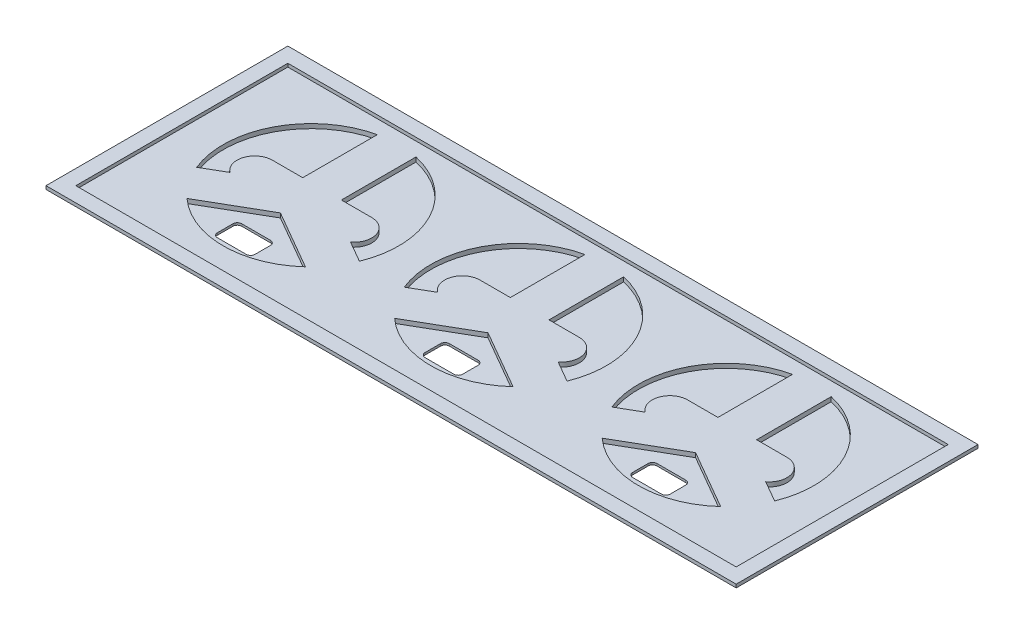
ISO-10303-21;
HEADER;
FILE_DESCRIPTION(('STEP AP214'),'2;1');
FILE_NAME('part.step','',(''),(''),'','','');
FILE_SCHEMA(('AUTOMOTIVE_DESIGN { 1 0 10303 214 1 1 1 1 }'));
ENDSEC;
DATA;
#1=APPLICATION_CONTEXT('core data for automotive mechanical design processes');
#2=APPLICATION_PROTOCOL_DEFINITION('international standard','automotive_design',2000,#1);
#3=PRODUCT_CONTEXT('',#1,'mechanical');
#4=PRODUCT('Part','Part','',(#3));
#5=PRODUCT_RELATED_PRODUCT_CATEGORY('part','',(#4));
#6=PRODUCT_DEFINITION_FORMATION('','',#4);
#7=PRODUCT_DEFINITION_CONTEXT('part definition',#1,'design');
#8=PRODUCT_DEFINITION('design','',#6,#7);
#9=PRODUCT_DEFINITION_SHAPE('','',#8);
#10=(LENGTH_UNIT() NAMED_UNIT(*) SI_UNIT(.MILLI.,.METRE.));
#11=(NAMED_UNIT(*) PLANE_ANGLE_UNIT() SI_UNIT($,.RADIAN.));
#12=(NAMED_UNIT(*) SI_UNIT($,.STERADIAN.) SOLID_ANGLE_UNIT());
#13=UNCERTAINTY_MEASURE_WITH_UNIT(LENGTH_MEASURE(1.E-05),#10,'distance_accuracy_value','');
#14=(GEOMETRIC_REPRESENTATION_CONTEXT(3) GLOBAL_UNCERTAINTY_ASSIGNED_CONTEXT((#13)) GLOBAL_UNIT_ASSIGNED_CONTEXT((#10,
#11,#12)) REPRESENTATION_CONTEXT('',''));
#15=CARTESIAN_POINT('',(0.,0.,0.));
#16=DIRECTION('',(0.,0.,1.));
#17=DIRECTION('',(1.,0.,0.));
#18=AXIS2_PLACEMENT_3D('',#15,#16,#17);
#19=CARTESIAN_POINT('',(-151.5,3.,50.));
#20=DIRECTION('',(0.,0.,-1.));
#21=DIRECTION('',(-1.,0.,0.));
#22=AXIS2_PLACEMENT_3D('',#19,#20,#21);
#23=PLANE('',#22);
#24=DIRECTION('',(1.,0.,0.));
#25=VECTOR('',#24,1.);
#26=CARTESIAN_POINT('',(156.25,3.,50.));
#27=LINE('',#26,#25);
#28=CARTESIAN_POINT('',(-151.5,3.,50.));
#29=VERTEX_POINT('',#28);
#30=CARTESIAN_POINT('',(151.5,3.,50.));
#31=VERTEX_POINT('',#30);
#32=EDGE_CURVE('E737',#29,#31,#27,.T.);
#33=ORIENTED_EDGE('',*,*,#32,.F.);
#34=DIRECTION('',(0.,-1.,0.));
#35=VECTOR('',#34,1.);
#36=CARTESIAN_POINT('',(-151.5,3.,50.));
#37=LINE('',#36,#35);
#38=CARTESIAN_POINT('',(-151.5,0.,50.));
#39=VERTEX_POINT('',#38);
#40=EDGE_CURVE('E1151',#29,#39,#37,.T.);
#41=ORIENTED_EDGE('',*,*,#40,.T.);
#42=DIRECTION('',(1.,0.,0.));
#43=VECTOR('',#42,1.);
#44=CARTESIAN_POINT('',(-151.5,0.,50.));
#45=LINE('',#44,#43);
#46=CARTESIAN_POINT('',(151.5,0.,50.));
#47=VERTEX_POINT('',#46);
#48=EDGE_CURVE('E1146',#39,#47,#45,.T.);
#49=ORIENTED_EDGE('',*,*,#48,.T.);
#50=DIRECTION('',(0.,-1.,0.));
#51=VECTOR('',#50,1.);
#52=CARTESIAN_POINT('',(151.5,3.,50.));
#53=LINE('',#52,#51);
#54=EDGE_CURVE('E1149',#31,#47,#53,.T.);
#55=ORIENTED_EDGE('',*,*,#54,.F.);
#56=EDGE_LOOP('',(#33,#41,#49,#55));
#57=FACE_BOUND('',#56,.T.);
#58=ADVANCED_FACE('F147',(#57),#23,.F.);
#59=CARTESIAN_POINT('',(0.,3.,0.));
#60=DIRECTION('',(0.,1.,0.));
#61=DIRECTION('',(0.,0.,1.));
#62=AXIS2_PLACEMENT_3D('',#59,#60,#61);
#63=PLANE('',#62);
#64=DIRECTION('',(-0.866025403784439,0.,-0.5));
#65=VECTOR('',#64,1.);
#66=CARTESIAN_POINT('',(27.5472860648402,3.,-47.7132990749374));
#67=LINE('',#66,#65);
#68=CARTESIAN_POINT('',(130.84206373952,3.,11.9239686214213));
#69=VERTEX_POINT('',#68);
#70=CARTESIAN_POINT('',(121.288796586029,3.,6.40838725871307));
#71=VERTEX_POINT('',#70);
#72=EDGE_CURVE('E972',#69,#71,#67,.T.);
#73=ORIENTED_EDGE('',*,*,#72,.T.);
#74=CARTESIAN_POINT('',(116.5,3.,0.));
#75=DIRECTION('',(0.,1.,0.));
#76=DIRECTION('',(0.,0.,-1.));
#77=AXIS2_PLACEMENT_3D('',#74,#75,#76);
#78=CIRCLE('',#77,7.99999999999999);
#79=CARTESIAN_POINT('',(116.5,3.,-8.00000000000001));
#80=VERTEX_POINT('',#79);
#81=EDGE_CURVE('E651',#71,#80,#78,.T.);
#82=ORIENTED_EDGE('',*,*,#81,.T.);
#83=DIRECTION('',(-1.,0.,0.));
#84=VECTOR('',#83,1.);
#85=CARTESIAN_POINT('',(116.5,3.,-8.00000000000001));
#86=LINE('',#85,#84);
#87=CARTESIAN_POINT('',(102.75,3.,-8.00000000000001));
#88=VERTEX_POINT('',#87);
#89=EDGE_CURVE('E648',#80,#88,#86,.T.);
#90=ORIENTED_EDGE('',*,*,#89,.T.);
#91=DIRECTION('',(0.,0.,1.));
#92=VECTOR('',#91,1.);
#93=CARTESIAN_POINT('',(102.75,3.,0.));
#94=LINE('',#93,#92);
#95=CARTESIAN_POINT('',(102.75,3.,-41.7749919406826));
#96=VERTEX_POINT('',#95);
#97=EDGE_CURVE('E170',#96,#88,#94,.T.);
#98=ORIENTED_EDGE('',*,*,#97,.F.);
#99=CARTESIAN_POINT('',(93.9999999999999,3.,-3.00000000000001));
#100=DIRECTION('',(0.,1.,0.));
#101=DIRECTION('',(0.,0.,1.));
#102=AXIS2_PLACEMENT_3D('',#99,#100,#101);
#103=CIRCLE('',#102,39.75);
#104=EDGE_CURVE('E939',#96,#69,#103,.F.);
#105=ORIENTED_EDGE('',*,*,#104,.T.);
#106=EDGE_LOOP('',(#73,#82,#90,#98,#105));
#107=FACE_BOUND('',#106,.T.);
#108=CARTESIAN_POINT('',(71.5,3.,0.));
#109=DIRECTION('',(0.,1.,0.));
#110=DIRECTION('',(0.,0.,-1.));
#111=AXIS2_PLACEMENT_3D('',#108,#109,#110);
#112=CIRCLE('',#111,7.99999999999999);
#113=CARTESIAN_POINT('',(71.5,3.,-8.00000000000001));
#114=VERTEX_POINT('',#113);
#115=CARTESIAN_POINT('',(66.7112034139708,3.,6.40838725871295));
#116=VERTEX_POINT('',#115);
#117=EDGE_CURVE('E631',#114,#116,#112,.T.);
#118=ORIENTED_EDGE('',*,*,#117,.T.);
#119=DIRECTION('',(0.86602540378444,0.,-0.499999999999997));
#120=VECTOR('',#119,1.);
#121=CARTESIAN_POINT('',(19.4527139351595,3.,33.6930888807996));
#122=LINE('',#121,#120);
#123=CARTESIAN_POINT('',(57.1579362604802,3.,11.9239686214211));
#124=VERTEX_POINT('',#123);
#125=EDGE_CURVE('E909',#124,#116,#122,.T.);
#126=ORIENTED_EDGE('',*,*,#125,.F.);
#127=CARTESIAN_POINT('',(93.9999999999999,3.,-3.00000000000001));
#128=DIRECTION('',(0.,1.,0.));
#129=DIRECTION('',(0.,0.,1.));
#130=AXIS2_PLACEMENT_3D('',#127,#128,#129);
#131=CIRCLE('',#130,39.75);
#132=CARTESIAN_POINT('',(85.2499999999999,3.,-41.7749919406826));
#133=VERTEX_POINT('',#132);
#134=EDGE_CURVE('E879',#124,#133,#131,.F.);
#135=ORIENTED_EDGE('',*,*,#134,.T.);
#136=DIRECTION('',(0.,0.,1.));
#137=VECTOR('',#136,1.);
#138=CARTESIAN_POINT('',(85.2499999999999,3.,0.));
#139=LINE('',#138,#137);
#140=CARTESIAN_POINT('',(85.2499999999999,3.,-8.00000000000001));
#141=VERTEX_POINT('',#140);
#142=EDGE_CURVE('E902',#133,#141,#139,.T.);
#143=ORIENTED_EDGE('',*,*,#142,.T.);
#144=EDGE_CURVE('E647',#141,#114,#86,.T.);
#145=ORIENTED_EDGE('',*,*,#144,.T.);
#146=EDGE_LOOP('',(#118,#126,#135,#143,#145));
#147=FACE_BOUND('',#146,.T.);
#148=DIRECTION('',(-0.866025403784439,0.,-0.5));
#149=VECTOR('',#148,1.);
#150=CARTESIAN_POINT('',(-19.4527139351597,3.,33.6930888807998));
#151=LINE('',#150,#149);
#152=CARTESIAN_POINT('',(-57.1579362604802,3.,11.9239686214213));
#153=VERTEX_POINT('',#152);
#154=CARTESIAN_POINT('',(-66.7112034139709,3.,6.40838725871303));
#155=VERTEX_POINT('',#154);
#156=EDGE_CURVE('E1082',#153,#155,#151,.T.);
#157=ORIENTED_EDGE('',*,*,#156,.T.);
#158=CARTESIAN_POINT('',(-71.5,3.,0.));
#159=DIRECTION('',(0.,1.,0.));
#160=DIRECTION('',(0.,0.,-1.));
#161=AXIS2_PLACEMENT_3D('',#158,#159,#160);
#162=CIRCLE('',#161,7.99999999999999);
#163=CARTESIAN_POINT('',(-71.5,3.,-7.99999999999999));
#164=VERTEX_POINT('',#163);
#165=EDGE_CURVE('E676',#155,#164,#162,.T.);
#166=ORIENTED_EDGE('',*,*,#165,.T.);
#167=DIRECTION('',(-1.,0.,0.));
#168=VECTOR('',#167,1.);
#169=CARTESIAN_POINT('',(-71.5,3.,-7.99999999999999));
#170=LINE('',#169,#168);
#171=CARTESIAN_POINT('',(-85.25,3.,-7.99999999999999));
#172=VERTEX_POINT('',#171);
#173=EDGE_CURVE('E673',#164,#172,#170,.T.);
#174=ORIENTED_EDGE('',*,*,#173,.T.);
#175=DIRECTION('',(0.,0.,1.));
#176=VECTOR('',#175,1.);
#177=CARTESIAN_POINT('',(-85.25,3.,0.));
#178=LINE('',#177,#176);
#179=CARTESIAN_POINT('',(-85.25,3.,-41.7749919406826));
#180=VERTEX_POINT('',#179);
#181=EDGE_CURVE('E1090',#180,#172,#178,.T.);
#182=ORIENTED_EDGE('',*,*,#181,.F.);
#183=CARTESIAN_POINT('',(-93.9999999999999,3.,-2.99999999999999));
#184=DIRECTION('',(0.,1.,0.));
#185=DIRECTION('',(0.,0.,1.));
#186=AXIS2_PLACEMENT_3D('',#183,#184,#185);
#187=CIRCLE('',#186,39.75);
#188=EDGE_CURVE('E1031',#180,#153,#187,.F.);
#189=ORIENTED_EDGE('',*,*,#188,.T.);
#190=EDGE_LOOP('',(#157,#166,#174,#182,#189));
#191=FACE_BOUND('',#190,.T.);
#192=CARTESIAN_POINT('',(-116.5,3.,0.));
#193=DIRECTION('',(0.,1.,0.));
#194=DIRECTION('',(0.,0.,-1.));
#195=AXIS2_PLACEMENT_3D('',#192,#193,#194);
#196=CIRCLE('',#195,7.99999999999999);
#197=CARTESIAN_POINT('',(-116.5,3.,-7.99999999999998));
#198=VERTEX_POINT('',#197);
#199=CARTESIAN_POINT('',(-121.288796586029,3.,6.40838725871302));
#200=VERTEX_POINT('',#199);
#201=EDGE_CURVE('E666',#198,#200,#196,.T.);
#202=ORIENTED_EDGE('',*,*,#201,.T.);
#203=DIRECTION('',(0.86602540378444,0.,-0.499999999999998));
#204=VECTOR('',#203,1.);
#205=CARTESIAN_POINT('',(-27.54728606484,3.,-47.7132990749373));
#206=LINE('',#205,#204);
#207=CARTESIAN_POINT('',(-130.84206373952,3.,11.9239686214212));
#208=VERTEX_POINT('',#207);
#209=EDGE_CURVE('E1024',#208,#200,#206,.T.);
#210=ORIENTED_EDGE('',*,*,#209,.F.);
#211=CARTESIAN_POINT('',(-93.9999999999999,3.,-2.99999999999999));
#212=DIRECTION('',(0.,1.,0.));
#213=DIRECTION('',(0.,0.,1.));
#214=AXIS2_PLACEMENT_3D('',#211,#212,#213);
#215=CIRCLE('',#214,39.75);
#216=CARTESIAN_POINT('',(-102.75,3.,-41.7749919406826));
#217=VERTEX_POINT('',#216);
#218=EDGE_CURVE('E1006',#208,#217,#215,.F.);
#219=ORIENTED_EDGE('',*,*,#218,.T.);
#220=DIRECTION('',(0.,0.,1.));
#221=VECTOR('',#220,1.);
#222=CARTESIAN_POINT('',(-102.75,3.,0.));
#223=LINE('',#222,#221);
#224=CARTESIAN_POINT('',(-102.75,3.,-7.99999999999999));
#225=VERTEX_POINT('',#224);
#226=EDGE_CURVE('E1015',#217,#225,#223,.T.);
#227=ORIENTED_EDGE('',*,*,#226,.T.);
#228=EDGE_CURVE('E672',#225,#198,#170,.T.);
#229=ORIENTED_EDGE('',*,*,#228,.T.);
#230=EDGE_LOOP('',(#202,#210,#219,#227,#229));
#231=FACE_BOUND('',#230,.T.);
#232=DIRECTION('',(0.,0.,1.));
#233=VECTOR('',#232,1.);
#234=CARTESIAN_POINT('',(-8.74999999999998,3.,0.));
#235=LINE('',#234,#233);
#236=CARTESIAN_POINT('',(-8.74999999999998,3.,-41.7749919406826));
#237=VERTEX_POINT('',#236);
#238=CARTESIAN_POINT('',(-8.74999999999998,3.,-8.));
#239=VERTEX_POINT('',#238);
#240=EDGE_CURVE('E1053',#237,#239,#235,.T.);
#241=ORIENTED_EDGE('',*,*,#240,.T.);
#242=DIRECTION('',(-1.,0.,0.));
#243=VECTOR('',#242,1.);
#244=CARTESIAN_POINT('',(-22.5,3.,-7.99999999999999));
#245=LINE('',#244,#243);
#246=CARTESIAN_POINT('',(-22.5,3.,-7.99999999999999));
#247=VERTEX_POINT('',#246);
#248=EDGE_CURVE('E702',#239,#247,#245,.T.);
#249=ORIENTED_EDGE('',*,*,#248,.T.);
#250=CARTESIAN_POINT('',(-22.5,3.,0.));
#251=DIRECTION('',(0.,1.,0.));
#252=DIRECTION('',(0.,0.,1.));
#253=AXIS2_PLACEMENT_3D('',#250,#251,#252);
#254=CIRCLE('',#253,7.99999999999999);
#255=CARTESIAN_POINT('',(-27.2887965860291,3.,6.40838725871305));
#256=VERTEX_POINT('',#255);
#257=EDGE_CURVE('E690',#247,#256,#254,.T.);
#258=ORIENTED_EDGE('',*,*,#257,.T.);
#259=DIRECTION('',(0.866025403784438,0.,-0.5));
#260=VECTOR('',#259,1.);
#261=CARTESIAN_POINT('',(-4.04728606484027,3.,-7.01010509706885));
#262=LINE('',#261,#260);
#263=CARTESIAN_POINT('',(-36.8420637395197,3.,11.9239686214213));
#264=VERTEX_POINT('',#263);
#265=EDGE_CURVE('E1062',#264,#256,#262,.T.);
#266=ORIENTED_EDGE('',*,*,#265,.F.);
#267=CARTESIAN_POINT('',(0.,3.,-3.));
#268=DIRECTION('',(0.,1.,0.));
#269=DIRECTION('',(0.,0.,1.));
#270=AXIS2_PLACEMENT_3D('',#267,#268,#269);
#271=CIRCLE('',#270,39.75);
#272=EDGE_CURVE('E1071',#237,#264,#271,.T.);
#273=ORIENTED_EDGE('',*,*,#272,.F.);
#274=EDGE_LOOP('',(#241,#249,#258,#266,#273));
#275=FACE_BOUND('',#274,.T.);
#276=DIRECTION('',(-0.86602540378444,0.,-0.499999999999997));
#277=VECTOR('',#276,1.);
#278=CARTESIAN_POINT('',(4.04728606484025,3.,-7.01010509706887));
#279=LINE('',#278,#277);
#280=CARTESIAN_POINT('',(36.8420637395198,3.,11.9239686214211));
#281=VERTEX_POINT('',#280);
#282=CARTESIAN_POINT('',(27.2887965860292,3.,6.40838725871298));
#283=VERTEX_POINT('',#282);
#284=EDGE_CURVE('E955',#281,#283,#279,.T.);
#285=ORIENTED_EDGE('',*,*,#284,.T.);
#286=CARTESIAN_POINT('',(22.5,3.,0.));
#287=DIRECTION('',(0.,1.,0.));
#288=DIRECTION('',(0.,0.,1.));
#289=AXIS2_PLACEMENT_3D('',#286,#287,#288);
#290=CIRCLE('',#289,7.99999999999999);
#291=CARTESIAN_POINT('',(22.5,3.,-8.));
#292=VERTEX_POINT('',#291);
#293=EDGE_CURVE('E700',#283,#292,#290,.T.);
#294=ORIENTED_EDGE('',*,*,#293,.T.);
#295=CARTESIAN_POINT('',(8.75000000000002,3.,-8.));
#296=VERTEX_POINT('',#295);
#297=EDGE_CURVE('E703',#292,#296,#245,.T.);
#298=ORIENTED_EDGE('',*,*,#297,.T.);
#299=DIRECTION('',(0.,0.,1.));
#300=VECTOR('',#299,1.);
#301=CARTESIAN_POINT('',(8.75000000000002,3.,0.));
#302=LINE('',#301,#300);
#303=CARTESIAN_POINT('',(8.75000000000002,3.,-41.7749919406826));
#304=VERTEX_POINT('',#303);
#305=EDGE_CURVE('E948',#304,#296,#302,.T.);
#306=ORIENTED_EDGE('',*,*,#305,.F.);
#307=CARTESIAN_POINT('',(0.,3.,-3.));
#308=DIRECTION('',(0.,1.,0.));
#309=DIRECTION('',(0.,0.,1.));
#310=AXIS2_PLACEMENT_3D('',#307,#308,#309);
#311=CIRCLE('',#310,39.75);
#312=EDGE_CURVE('E958',#281,#304,#311,.T.);
#313=ORIENTED_EDGE('',*,*,#312,.F.);
#314=EDGE_LOOP('',(#285,#294,#298,#306,#313));
#315=FACE_BOUND('',#314,.T.);
#316=DIRECTION('',(0.,0.,-1.));
#317=VECTOR('',#316,1.);
#318=CARTESIAN_POINT('',(149.5,3.,0.));
#319=LINE('',#318,#317);
#320=CARTESIAN_POINT('',(149.5,3.,48.));
#321=VERTEX_POINT('',#320);
#322=CARTESIAN_POINT('',(149.5,3.,-48.));
#323=VERTEX_POINT('',#322);
#324=EDGE_CURVE('E1104',#321,#323,#319,.T.);
#325=ORIENTED_EDGE('',*,*,#324,.T.);
#326=DIRECTION('',(-1.,0.,0.));
#327=VECTOR('',#326,1.);
#328=CARTESIAN_POINT('',(0.,3.,-48.));
#329=LINE('',#328,#327);
#330=CARTESIAN_POINT('',(-149.5,3.,-48.));
#331=VERTEX_POINT('',#330);
#332=EDGE_CURVE('E1110',#323,#331,#329,.T.);
#333=ORIENTED_EDGE('',*,*,#332,.T.);
#334=DIRECTION('',(0.,0.,1.));
#335=VECTOR('',#334,1.);
#336=CARTESIAN_POINT('',(-149.5,3.,0.));
#337=LINE('',#336,#335);
#338=CARTESIAN_POINT('',(-149.5,3.,48.));
#339=VERTEX_POINT('',#338);
#340=EDGE_CURVE('E1123',#331,#339,#337,.T.);
#341=ORIENTED_EDGE('',*,*,#340,.T.);
#342=DIRECTION('',(1.,0.,0.));
#343=VECTOR('',#342,1.);
#344=CARTESIAN_POINT('',(0.,3.,48.));
#345=LINE('',#344,#343);
#346=EDGE_CURVE('E1121',#339,#321,#345,.T.);
#347=ORIENTED_EDGE('',*,*,#346,.T.);
#348=EDGE_LOOP('',(#325,#333,#341,#347));
#349=FACE_BOUND('',#348,.T.);
#350=DIRECTION('',(-0.866025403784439,0.,-0.5));
#351=VECTOR('',#350,1.);
#352=CARTESIAN_POINT('',(18.7972860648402,3.,-32.5578545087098));
#353=LINE('',#352,#351);
#354=CARTESIAN_POINT('',(120.81567918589,3.,26.3424922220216));
#355=VERTEX_POINT('',#354);
#356=CARTESIAN_POINT('',(93.9999999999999,3.,10.8604526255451));
#357=VERTEX_POINT('',#356);
#358=EDGE_CURVE('E931',#355,#357,#353,.T.);
#359=ORIENTED_EDGE('',*,*,#358,.F.);
#360=CARTESIAN_POINT('',(93.9999999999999,3.,-3.00000000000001));
#361=DIRECTION('',(0.,1.,0.));
#362=DIRECTION('',(0.,0.,1.));
#363=AXIS2_PLACEMENT_3D('',#360,#361,#362);
#364=CIRCLE('',#363,39.75);
#365=CARTESIAN_POINT('',(67.1843208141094,3.,26.3424922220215));
#366=VERTEX_POINT('',#365);
#367=EDGE_CURVE('E916',#355,#366,#364,.F.);
#368=ORIENTED_EDGE('',*,*,#367,.T.);
#369=DIRECTION('',(0.86602540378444,0.,-0.499999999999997));
#370=VECTOR('',#369,1.);
#371=CARTESIAN_POINT('',(28.2027139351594,3.,48.8485334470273));
#372=LINE('',#371,#370);
#373=EDGE_CURVE('E923',#366,#357,#372,.T.);
#374=ORIENTED_EDGE('',*,*,#373,.T.);
#375=EDGE_LOOP('',(#359,#368,#374));
#376=FACE_BOUND('',#375,.T.);
#377=CARTESIAN_POINT('',(0.,3.,-3.));
#378=DIRECTION('',(0.,1.,0.));
#379=DIRECTION('',(0.,0.,1.));
#380=AXIS2_PLACEMENT_3D('',#377,#378,#379);
#381=CIRCLE('',#380,39.75);
#382=CARTESIAN_POINT('',(-26.8156791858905,3.,26.3424922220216));
#383=VERTEX_POINT('',#382);
#384=CARTESIAN_POINT('',(26.8156791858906,3.,26.3424922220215));
#385=VERTEX_POINT('',#384);
#386=EDGE_CURVE('E1046',#383,#385,#381,.T.);
#387=ORIENTED_EDGE('',*,*,#386,.F.);
#388=DIRECTION('',(0.866025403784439,0.,-0.5));
#389=VECTOR('',#388,1.);
#390=CARTESIAN_POINT('',(4.70271393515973,3.,8.14533946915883));
#391=LINE('',#390,#389);
#392=CARTESIAN_POINT('',(0.,3.,10.8604526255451));
#393=VERTEX_POINT('',#392);
#394=EDGE_CURVE('E965',#383,#393,#391,.T.);
#395=ORIENTED_EDGE('',*,*,#394,.T.);
#396=DIRECTION('',(-0.86602540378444,0.,-0.499999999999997));
#397=VECTOR('',#396,1.);
#398=CARTESIAN_POINT('',(-4.7027139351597,3.,8.14533946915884));
#399=LINE('',#398,#397);
#400=EDGE_CURVE('E1037',#385,#393,#399,.T.);
#401=ORIENTED_EDGE('',*,*,#400,.F.);
#402=EDGE_LOOP('',(#387,#395,#401));
#403=FACE_BOUND('',#402,.T.);
#404=DIRECTION('',(-0.866025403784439,0.,-0.5));
#405=VECTOR('',#404,1.);
#406=CARTESIAN_POINT('',(-28.2027139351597,3.,48.8485334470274));
#407=LINE('',#406,#405);
#408=CARTESIAN_POINT('',(-67.1843208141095,3.,26.3424922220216));
#409=VERTEX_POINT('',#408);
#410=CARTESIAN_POINT('',(-94.,3.,10.8604526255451));
#411=VERTEX_POINT('',#410);
#412=EDGE_CURVE('E997',#409,#411,#407,.T.);
#413=ORIENTED_EDGE('',*,*,#412,.F.);
#414=CARTESIAN_POINT('',(-93.9999999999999,3.,-2.99999999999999));
#415=DIRECTION('',(0.,1.,0.));
#416=DIRECTION('',(0.,0.,1.));
#417=AXIS2_PLACEMENT_3D('',#414,#415,#416);
#418=CIRCLE('',#417,39.75);
#419=CARTESIAN_POINT('',(-120.815679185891,3.,26.3424922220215));
#420=VERTEX_POINT('',#419);
#421=EDGE_CURVE('E994',#409,#420,#418,.F.);
#422=ORIENTED_EDGE('',*,*,#421,.T.);
#423=DIRECTION('',(0.86602540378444,0.,-0.499999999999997));
#424=VECTOR('',#423,1.);
#425=CARTESIAN_POINT('',(-18.79728606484,3.,-32.5578545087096));
#426=LINE('',#425,#424);
#427=EDGE_CURVE('E988',#420,#411,#426,.T.);
#428=ORIENTED_EDGE('',*,*,#427,.T.);
#429=EDGE_LOOP('',(#413,#422,#428));
#430=FACE_BOUND('',#429,.T.);
#431=ADVANCED_FACE('F1223',(#107,#147,#191,#231,#275,#315,#349,#376,#403,#430),#63,.T.);
#432=CARTESIAN_POINT('',(151.5,3.,-50.));
#433=DIRECTION('',(-1.,0.,0.));
#434=DIRECTION('',(0.,0.,1.));
#435=AXIS2_PLACEMENT_3D('',#432,#433,#434);
#436=PLANE('',#435);
#437=DIRECTION('',(0.,0.,-1.));
#438=VECTOR('',#437,1.);
#439=CARTESIAN_POINT('',(151.5,3.,50.));
#440=LINE('',#439,#438);
#441=CARTESIAN_POINT('',(151.5,3.,-50.));
#442=VERTEX_POINT('',#441);
#443=EDGE_CURVE('E1097',#31,#442,#440,.T.);
#444=ORIENTED_EDGE('',*,*,#443,.F.);
#445=ORIENTED_EDGE('',*,*,#54,.T.);
#446=DIRECTION('',(0.,0.,-1.));
#447=VECTOR('',#446,1.);
#448=CARTESIAN_POINT('',(151.5,0.,-50.));
#449=LINE('',#448,#447);
#450=CARTESIAN_POINT('',(151.5,0.,-50.));
#451=VERTEX_POINT('',#450);
#452=EDGE_CURVE('E1137',#47,#451,#449,.T.);
#453=ORIENTED_EDGE('',*,*,#452,.T.);
#454=DIRECTION('',(0.,-1.,0.));
#455=VECTOR('',#454,1.);
#456=CARTESIAN_POINT('',(151.5,3.,-50.));
#457=LINE('',#456,#455);
#458=EDGE_CURVE('E1155',#442,#451,#457,.T.);
#459=ORIENTED_EDGE('',*,*,#458,.F.);
#460=EDGE_LOOP('',(#444,#445,#453,#459));
#461=FACE_BOUND('',#460,.T.);
#462=ADVANCED_FACE('F149',(#461),#436,.F.);
#463=CARTESIAN_POINT('',(-151.5,3.,-50.));
#464=DIRECTION('',(0.,0.,1.));
#465=DIRECTION('',(1.,0.,0.));
#466=AXIS2_PLACEMENT_3D('',#463,#464,#465);
#467=PLANE('',#466);
#468=DIRECTION('',(0.,-1.,0.));
#469=VECTOR('',#468,1.);
#470=CARTESIAN_POINT('',(-151.5,3.,-50.));
#471=LINE('',#470,#469);
#472=CARTESIAN_POINT('',(-151.5,3.,-50.));
#473=VERTEX_POINT('',#472);
#474=CARTESIAN_POINT('',(-151.5,0.,-50.));
#475=VERTEX_POINT('',#474);
#476=EDGE_CURVE('E1153',#473,#475,#471,.T.);
#477=ORIENTED_EDGE('',*,*,#476,.F.);
#478=DIRECTION('',(1.,0.,0.));
#479=VECTOR('',#478,1.);
#480=CARTESIAN_POINT('',(156.25,3.,-50.));
#481=LINE('',#480,#479);
#482=EDGE_CURVE('E733',#473,#442,#481,.T.);
#483=ORIENTED_EDGE('',*,*,#482,.T.);
#484=ORIENTED_EDGE('',*,*,#458,.T.);
#485=DIRECTION('',(-1.,0.,0.));
#486=VECTOR('',#485,1.);
#487=CARTESIAN_POINT('',(-151.5,0.,-50.));
#488=LINE('',#487,#486);
#489=EDGE_CURVE('E1140',#451,#475,#488,.T.);
#490=ORIENTED_EDGE('',*,*,#489,.T.);
#491=EDGE_LOOP('',(#477,#483,#484,#490));
#492=FACE_BOUND('',#491,.T.);
#493=ADVANCED_FACE('F1258',(#492),#467,.F.);
#494=CARTESIAN_POINT('',(-151.5,3.,-50.));
#495=DIRECTION('',(1.,0.,0.));
#496=DIRECTION('',(0.,0.,-1.));
#497=AXIS2_PLACEMENT_3D('',#494,#495,#496);
#498=PLANE('',#497);
#499=ORIENTED_EDGE('',*,*,#40,.F.);
#500=DIRECTION('',(0.,0.,-1.));
#501=VECTOR('',#500,1.);
#502=CARTESIAN_POINT('',(-151.5,3.,50.));
#503=LINE('',#502,#501);
#504=EDGE_CURVE('E749',#29,#473,#503,.T.);
#505=ORIENTED_EDGE('',*,*,#504,.T.);
#506=ORIENTED_EDGE('',*,*,#476,.T.);
#507=DIRECTION('',(0.,0.,1.));
#508=VECTOR('',#507,1.);
#509=CARTESIAN_POINT('',(-151.5,0.,-50.));
#510=LINE('',#509,#508);
#511=EDGE_CURVE('E1143',#475,#39,#510,.T.);
#512=ORIENTED_EDGE('',*,*,#511,.T.);
#513=EDGE_LOOP('',(#499,#505,#506,#512));
#514=FACE_BOUND('',#513,.T.);
#515=ADVANCED_FACE('F1256',(#514),#498,.F.);
#516=CARTESIAN_POINT('',(0.,0.,0.));
#517=DIRECTION('',(0.,1.,0.));
#518=DIRECTION('',(0.,0.,1.));
#519=AXIS2_PLACEMENT_3D('',#516,#517,#518);
#520=PLANE('',#519);
#521=DIRECTION('',(1.,0.,0.));
#522=VECTOR('',#521,1.);
#523=CARTESIAN_POINT('',(-100.5,0.,32.8604526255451));
#524=LINE('',#523,#522);
#525=CARTESIAN_POINT('',(-100.5,0.,32.8604526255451));
#526=VERTEX_POINT('',#525);
#527=CARTESIAN_POINT('',(-87.5,0.,32.8604526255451));
#528=VERTEX_POINT('',#527);
#529=EDGE_CURVE('E809',#526,#528,#524,.T.);
#530=ORIENTED_EDGE('',*,*,#529,.T.);
#531=CARTESIAN_POINT('',(-87.5,0.,30.8604526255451));
#532=DIRECTION('',(0.,1.,0.));
#533=DIRECTION('',(0.,0.,1.));
#534=AXIS2_PLACEMENT_3D('',#531,#532,#533);
#535=CIRCLE('',#534,2.);
#536=CARTESIAN_POINT('',(-85.5,0.,30.8604526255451));
#537=VERTEX_POINT('',#536);
#538=EDGE_CURVE('E782',#528,#537,#535,.T.);
#539=ORIENTED_EDGE('',*,*,#538,.T.);
#540=DIRECTION('',(0.,0.,-1.));
#541=VECTOR('',#540,1.);
#542=CARTESIAN_POINT('',(-85.5,0.,23.8604526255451));
#543=LINE('',#542,#541);
#544=CARTESIAN_POINT('',(-85.5,0.,23.8604526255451));
#545=VERTEX_POINT('',#544);
#546=EDGE_CURVE('E847',#537,#545,#543,.T.);
#547=ORIENTED_EDGE('',*,*,#546,.T.);
#548=CARTESIAN_POINT('',(-87.5,0.,23.8604526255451));
#549=DIRECTION('',(0.,1.,0.));
#550=DIRECTION('',(0.,0.,-1.));
#551=AXIS2_PLACEMENT_3D('',#548,#549,#550);
#552=CIRCLE('',#551,2.);
#553=CARTESIAN_POINT('',(-87.5,0.,21.8604526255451));
#554=VERTEX_POINT('',#553);
#555=EDGE_CURVE('E844',#545,#554,#552,.T.);
#556=ORIENTED_EDGE('',*,*,#555,.T.);
#557=DIRECTION('',(-1.,0.,0.));
#558=VECTOR('',#557,1.);
#559=CARTESIAN_POINT('',(-100.5,0.,21.8604526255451));
#560=LINE('',#559,#558);
#561=CARTESIAN_POINT('',(-100.5,0.,21.8604526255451));
#562=VERTEX_POINT('',#561);
#563=EDGE_CURVE('E841',#554,#562,#560,.T.);
#564=ORIENTED_EDGE('',*,*,#563,.T.);
#565=CARTESIAN_POINT('',(-100.5,0.,23.8604526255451));
#566=DIRECTION('',(0.,1.,0.));
#567=DIRECTION('',(0.,0.,1.));
#568=AXIS2_PLACEMENT_3D('',#565,#566,#567);
#569=CIRCLE('',#568,2.);
#570=CARTESIAN_POINT('',(-102.5,0.,23.8604526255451));
#571=VERTEX_POINT('',#570);
#572=EDGE_CURVE('E838',#562,#571,#569,.T.);
#573=ORIENTED_EDGE('',*,*,#572,.T.);
#574=DIRECTION('',(0.,0.,1.));
#575=VECTOR('',#574,1.);
#576=CARTESIAN_POINT('',(-102.5,0.,23.8604526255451));
#577=LINE('',#576,#575);
#578=CARTESIAN_POINT('',(-102.5,0.,30.8604526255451));
#579=VERTEX_POINT('',#578);
#580=EDGE_CURVE('E835',#571,#579,#577,.T.);
#581=ORIENTED_EDGE('',*,*,#580,.T.);
#582=CARTESIAN_POINT('',(-100.5,0.,30.8604526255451));
#583=DIRECTION('',(0.,1.,0.));
#584=DIRECTION('',(0.,0.,1.));
#585=AXIS2_PLACEMENT_3D('',#582,#583,#584);
#586=CIRCLE('',#585,2.);
#587=EDGE_CURVE('E832',#579,#526,#586,.T.);
#588=ORIENTED_EDGE('',*,*,#587,.T.);
#589=EDGE_LOOP('',(#530,#539,#547,#556,#564,#573,#581,#588));
#590=FACE_BOUND('',#589,.T.);
#591=DIRECTION('',(0.,0.,1.));
#592=VECTOR('',#591,1.);
#593=CARTESIAN_POINT('',(85.5,0.,23.8604526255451));
#594=LINE('',#593,#592);
#595=CARTESIAN_POINT('',(85.5,0.,23.8604526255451));
#596=VERTEX_POINT('',#595);
#597=CARTESIAN_POINT('',(85.5,0.,30.8604526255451));
#598=VERTEX_POINT('',#597);
#599=EDGE_CURVE('E760',#596,#598,#594,.T.);
#600=ORIENTED_EDGE('',*,*,#599,.T.);
#601=CARTESIAN_POINT('',(87.5,0.,30.8604526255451));
#602=DIRECTION('',(0.,1.,0.));
#603=DIRECTION('',(0.,0.,1.));
#604=AXIS2_PLACEMENT_3D('',#601,#602,#603);
#605=CIRCLE('',#604,2.);
#606=CARTESIAN_POINT('',(87.5,0.,32.8604526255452));
#607=VERTEX_POINT('',#606);
#608=EDGE_CURVE('E803',#598,#607,#605,.T.);
#609=ORIENTED_EDGE('',*,*,#608,.T.);
#610=DIRECTION('',(1.,0.,0.));
#611=VECTOR('',#610,1.);
#612=CARTESIAN_POINT('',(87.5,0.,32.8604526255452));
#613=LINE('',#612,#611);
#614=CARTESIAN_POINT('',(100.5,0.,32.8604526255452));
#615=VERTEX_POINT('',#614);
#616=EDGE_CURVE('E800',#607,#615,#613,.T.);
#617=ORIENTED_EDGE('',*,*,#616,.T.);
#618=CARTESIAN_POINT('',(100.5,0.,30.8604526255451));
#619=DIRECTION('',(0.,1.,0.));
#620=DIRECTION('',(0.,0.,1.));
#621=AXIS2_PLACEMENT_3D('',#618,#619,#620);
#622=CIRCLE('',#621,2.);
#623=CARTESIAN_POINT('',(102.5,0.,30.8604526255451));
#624=VERTEX_POINT('',#623);
#625=EDGE_CURVE('E797',#615,#624,#622,.T.);
#626=ORIENTED_EDGE('',*,*,#625,.T.);
#627=DIRECTION('',(0.,0.,-1.));
#628=VECTOR('',#627,1.);
#629=CARTESIAN_POINT('',(102.5,0.,23.8604526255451));
#630=LINE('',#629,#628);
#631=CARTESIAN_POINT('',(102.5,0.,23.8604526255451));
#632=VERTEX_POINT('',#631);
#633=EDGE_CURVE('E794',#624,#632,#630,.T.);
#634=ORIENTED_EDGE('',*,*,#633,.T.);
#635=CARTESIAN_POINT('',(100.5,0.,23.8604526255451));
#636=DIRECTION('',(0.,1.,0.));
#637=DIRECTION('',(0.,0.,-1.));
#638=AXIS2_PLACEMENT_3D('',#635,#636,#637);
#639=CIRCLE('',#638,2.);
#640=CARTESIAN_POINT('',(100.5,0.,21.8604526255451));
#641=VERTEX_POINT('',#640);
#642=EDGE_CURVE('E791',#632,#641,#639,.T.);
#643=ORIENTED_EDGE('',*,*,#642,.T.);
#644=DIRECTION('',(-1.,0.,0.));
#645=VECTOR('',#644,1.);
#646=CARTESIAN_POINT('',(87.5,0.,21.8604526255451));
#647=LINE('',#646,#645);
#648=CARTESIAN_POINT('',(87.5,0.,21.8604526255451));
#649=VERTEX_POINT('',#648);
#650=EDGE_CURVE('E788',#641,#649,#647,.T.);
#651=ORIENTED_EDGE('',*,*,#650,.T.);
#652=CARTESIAN_POINT('',(87.5,0.,23.8604526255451));
#653=DIRECTION('',(0.,1.,0.));
#654=DIRECTION('',(0.,0.,1.));
#655=AXIS2_PLACEMENT_3D('',#652,#653,#654);
#656=CIRCLE('',#655,2.);
#657=EDGE_CURVE('E785',#649,#596,#656,.T.);
#658=ORIENTED_EDGE('',*,*,#657,.T.);
#659=EDGE_LOOP('',(#600,#609,#617,#626,#634,#643,#651,#658));
#660=FACE_BOUND('',#659,.T.);
#661=DIRECTION('',(-1.,0.,0.));
#662=VECTOR('',#661,1.);
#663=CARTESIAN_POINT('',(-6.49999999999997,0.,21.8604526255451));
#664=LINE('',#663,#662);
#665=CARTESIAN_POINT('',(6.50000000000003,0.,21.8604526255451));
#666=VERTEX_POINT('',#665);
#667=CARTESIAN_POINT('',(-6.49999999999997,0.,21.8604526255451));
#668=VERTEX_POINT('',#667);
#669=EDGE_CURVE('E872',#666,#668,#664,.T.);
#670=ORIENTED_EDGE('',*,*,#669,.T.);
#671=CARTESIAN_POINT('',(-6.49999999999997,0.,23.8604526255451));
#672=DIRECTION('',(0.,1.,0.));
#673=DIRECTION('',(0.,0.,1.));
#674=AXIS2_PLACEMENT_3D('',#671,#672,#673);
#675=CIRCLE('',#674,2.);
#676=CARTESIAN_POINT('',(-8.49999999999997,0.,23.8604526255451));
#677=VERTEX_POINT('',#676);
#678=EDGE_CURVE('E806',#668,#677,#675,.T.);
#679=ORIENTED_EDGE('',*,*,#678,.T.);
#680=DIRECTION('',(0.,0.,1.));
#681=VECTOR('',#680,1.);
#682=CARTESIAN_POINT('',(-8.49999999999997,0.,23.8604526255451));
#683=LINE('',#682,#681);
#684=CARTESIAN_POINT('',(-8.49999999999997,0.,30.8604526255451));
#685=VERTEX_POINT('',#684);
#686=EDGE_CURVE('E854',#677,#685,#683,.T.);
#687=ORIENTED_EDGE('',*,*,#686,.T.);
#688=CARTESIAN_POINT('',(-6.49999999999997,0.,30.8604526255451));
#689=DIRECTION('',(0.,1.,0.));
#690=DIRECTION('',(0.,0.,1.));
#691=AXIS2_PLACEMENT_3D('',#688,#689,#690);
#692=CIRCLE('',#691,2.);
#693=CARTESIAN_POINT('',(-6.49999999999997,0.,32.8604526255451));
#694=VERTEX_POINT('',#693);
#695=EDGE_CURVE('E857',#685,#694,#692,.T.);
#696=ORIENTED_EDGE('',*,*,#695,.T.);
#697=DIRECTION('',(1.,0.,0.));
#698=VECTOR('',#697,1.);
#699=CARTESIAN_POINT('',(-6.49999999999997,0.,32.8604526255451));
#700=LINE('',#699,#698);
#701=CARTESIAN_POINT('',(6.50000000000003,0.,32.8604526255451));
#702=VERTEX_POINT('',#701);
#703=EDGE_CURVE('E860',#694,#702,#700,.T.);
#704=ORIENTED_EDGE('',*,*,#703,.T.);
#705=CARTESIAN_POINT('',(6.50000000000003,0.,30.8604526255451));
#706=DIRECTION('',(0.,1.,0.));
#707=DIRECTION('',(0.,0.,1.));
#708=AXIS2_PLACEMENT_3D('',#705,#706,#707);
#709=CIRCLE('',#708,2.);
#710=CARTESIAN_POINT('',(8.50000000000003,0.,30.8604526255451));
#711=VERTEX_POINT('',#710);
#712=EDGE_CURVE('E863',#702,#711,#709,.T.);
#713=ORIENTED_EDGE('',*,*,#712,.T.);
#714=DIRECTION('',(0.,0.,-1.));
#715=VECTOR('',#714,1.);
#716=CARTESIAN_POINT('',(8.50000000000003,0.,23.8604526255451));
#717=LINE('',#716,#715);
#718=CARTESIAN_POINT('',(8.50000000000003,0.,23.8604526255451));
#719=VERTEX_POINT('',#718);
#720=EDGE_CURVE('E866',#711,#719,#717,.T.);
#721=ORIENTED_EDGE('',*,*,#720,.T.);
#722=CARTESIAN_POINT('',(6.50000000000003,0.,23.8604526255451));
#723=DIRECTION('',(0.,1.,0.));
#724=DIRECTION('',(0.,0.,-1.));
#725=AXIS2_PLACEMENT_3D('',#722,#723,#724);
#726=CIRCLE('',#725,2.);
#727=EDGE_CURVE('E869',#719,#666,#726,.T.);
#728=ORIENTED_EDGE('',*,*,#727,.T.);
#729=EDGE_LOOP('',(#670,#679,#687,#696,#704,#713,#721,#728));
#730=FACE_BOUND('',#729,.T.);
#731=ORIENTED_EDGE('',*,*,#452,.F.);
#732=ORIENTED_EDGE('',*,*,#48,.F.);
#733=ORIENTED_EDGE('',*,*,#511,.F.);
#734=ORIENTED_EDGE('',*,*,#489,.F.);
#735=EDGE_LOOP('',(#731,#732,#733,#734));
#736=FACE_BOUND('',#735,.T.);
#737=ADVANCED_FACE('F1255',(#590,#660,#730,#736),#520,.F.);
#738=CARTESIAN_POINT('',(149.5,4.5,0.));
#739=DIRECTION('',(-1.,0.,0.));
#740=DIRECTION('',(0.,0.,1.));
#741=AXIS2_PLACEMENT_3D('',#738,#739,#740);
#742=PLANE('',#741);
#743=ORIENTED_EDGE('',*,*,#324,.F.);
#744=DIRECTION('',(0.,-1.,0.));
#745=VECTOR('',#744,1.);
#746=CARTESIAN_POINT('',(149.5,4.5,48.));
#747=LINE('',#746,#745);
#748=CARTESIAN_POINT('',(149.5,4.5,48.));
#749=VERTEX_POINT('',#748);
#750=EDGE_CURVE('E1134',#749,#321,#747,.T.);
#751=ORIENTED_EDGE('',*,*,#750,.F.);
#752=DIRECTION('',(0.,0.,-1.));
#753=VECTOR('',#752,1.);
#754=CARTESIAN_POINT('',(149.5,4.5,0.));
#755=LINE('',#754,#753);
#756=CARTESIAN_POINT('',(149.5,4.5,-48.));
#757=VERTEX_POINT('',#756);
#758=EDGE_CURVE('E1106',#749,#757,#755,.T.);
#759=ORIENTED_EDGE('',*,*,#758,.T.);
#760=DIRECTION('',(0.,-1.,0.));
#761=VECTOR('',#760,1.);
#762=CARTESIAN_POINT('',(149.5,4.5,-48.));
#763=LINE('',#762,#761);
#764=EDGE_CURVE('E1119',#757,#323,#763,.T.);
#765=ORIENTED_EDGE('',*,*,#764,.T.);
#766=EDGE_LOOP('',(#743,#751,#759,#765));
#767=FACE_BOUND('',#766,.T.);
#768=ADVANCED_FACE('F1282',(#767),#742,.T.);
#769=CARTESIAN_POINT('',(0.,4.5,48.));
#770=DIRECTION('',(0.,0.,-1.));
#771=DIRECTION('',(-1.,0.,0.));
#772=AXIS2_PLACEMENT_3D('',#769,#770,#771);
#773=PLANE('',#772);
#774=ORIENTED_EDGE('',*,*,#346,.F.);
#775=DIRECTION('',(0.,-1.,0.));
#776=VECTOR('',#775,1.);
#777=CARTESIAN_POINT('',(-149.5,4.5,48.));
#778=LINE('',#777,#776);
#779=CARTESIAN_POINT('',(-149.5,4.5,48.));
#780=VERTEX_POINT('',#779);
#781=EDGE_CURVE('E1131',#780,#339,#778,.T.);
#782=ORIENTED_EDGE('',*,*,#781,.F.);
#783=DIRECTION('',(1.,0.,0.));
#784=VECTOR('',#783,1.);
#785=CARTESIAN_POINT('',(0.,4.5,48.));
#786=LINE('',#785,#784);
#787=EDGE_CURVE('E1109',#780,#749,#786,.T.);
#788=ORIENTED_EDGE('',*,*,#787,.T.);
#789=ORIENTED_EDGE('',*,*,#750,.T.);
#790=EDGE_LOOP('',(#774,#782,#788,#789));
#791=FACE_BOUND('',#790,.T.);
#792=ADVANCED_FACE('F1287',(#791),#773,.T.);
#793=CARTESIAN_POINT('',(-149.5,4.5,0.));
#794=DIRECTION('',(1.,0.,0.));
#795=DIRECTION('',(0.,0.,-1.));
#796=AXIS2_PLACEMENT_3D('',#793,#794,#795);
#797=PLANE('',#796);
#798=ORIENTED_EDGE('',*,*,#340,.F.);
#799=DIRECTION('',(0.,-1.,0.));
#800=VECTOR('',#799,1.);
#801=CARTESIAN_POINT('',(-149.5,4.5,-48.));
#802=LINE('',#801,#800);
#803=CARTESIAN_POINT('',(-149.5,4.5,-48.));
#804=VERTEX_POINT('',#803);
#805=EDGE_CURVE('E1128',#804,#331,#802,.T.);
#806=ORIENTED_EDGE('',*,*,#805,.F.);
#807=DIRECTION('',(0.,0.,1.));
#808=VECTOR('',#807,1.);
#809=CARTESIAN_POINT('',(-149.5,4.5,0.));
#810=LINE('',#809,#808);
#811=EDGE_CURVE('E1113',#804,#780,#810,.T.);
#812=ORIENTED_EDGE('',*,*,#811,.T.);
#813=ORIENTED_EDGE('',*,*,#781,.T.);
#814=EDGE_LOOP('',(#798,#806,#812,#813));
#815=FACE_BOUND('',#814,.T.);
#816=ADVANCED_FACE('F2193',(#815),#797,.T.);
#817=CARTESIAN_POINT('',(0.,4.5,-48.));
#818=DIRECTION('',(0.,0.,1.));
#819=DIRECTION('',(1.,0.,0.));
#820=AXIS2_PLACEMENT_3D('',#817,#818,#819);
#821=PLANE('',#820);
#822=ORIENTED_EDGE('',*,*,#332,.F.);
#823=ORIENTED_EDGE('',*,*,#764,.F.);
#824=DIRECTION('',(-1.,0.,0.));
#825=VECTOR('',#824,1.);
#826=CARTESIAN_POINT('',(0.,4.5,-48.));
#827=LINE('',#826,#825);
#828=EDGE_CURVE('E1116',#757,#804,#827,.T.);
#829=ORIENTED_EDGE('',*,*,#828,.T.);
#830=ORIENTED_EDGE('',*,*,#805,.T.);
#831=EDGE_LOOP('',(#822,#823,#829,#830));
#832=FACE_BOUND('',#831,.T.);
#833=ADVANCED_FACE('F1738',(#832),#821,.T.);
#834=CARTESIAN_POINT('',(0.,4.5,0.));
#835=DIRECTION('',(0.,1.,0.));
#836=DIRECTION('',(0.,0.,1.));
#837=AXIS2_PLACEMENT_3D('',#834,#835,#836);
#838=PLANE('',#837);
#839=ORIENTED_EDGE('',*,*,#758,.F.);
#840=ORIENTED_EDGE('',*,*,#787,.F.);
#841=ORIENTED_EDGE('',*,*,#811,.F.);
#842=ORIENTED_EDGE('',*,*,#828,.F.);
#843=EDGE_LOOP('',(#839,#840,#841,#842));
#844=FACE_BOUND('',#843,.T.);
#845=DIRECTION('',(0.,0.,1.));
#846=VECTOR('',#845,1.);
#847=CARTESIAN_POINT('',(-156.25,4.5,50.));
#848=LINE('',#847,#846);
#849=CARTESIAN_POINT('',(-156.25,4.5,-54.75));
#850=VERTEX_POINT('',#849);
#851=CARTESIAN_POINT('',(-156.25,4.5,54.75));
#852=VERTEX_POINT('',#851);
#853=EDGE_CURVE('E752',#850,#852,#848,.T.);
#854=ORIENTED_EDGE('',*,*,#853,.T.);
#855=DIRECTION('',(-1.,0.,0.));
#856=VECTOR('',#855,1.);
#857=CARTESIAN_POINT('',(156.25,4.5,54.75));
#858=LINE('',#857,#856);
#859=CARTESIAN_POINT('',(156.25,4.5,54.75));
#860=VERTEX_POINT('',#859);
#861=EDGE_CURVE('E740',#860,#852,#858,.T.);
#862=ORIENTED_EDGE('',*,*,#861,.F.);
#863=DIRECTION('',(0.,0.,1.));
#864=VECTOR('',#863,1.);
#865=CARTESIAN_POINT('',(156.25,4.5,50.));
#866=LINE('',#865,#864);
#867=CARTESIAN_POINT('',(156.25,4.5,-54.75));
#868=VERTEX_POINT('',#867);
#869=EDGE_CURVE('E1102',#868,#860,#866,.T.);
#870=ORIENTED_EDGE('',*,*,#869,.F.);
#871=DIRECTION('',(-1.,0.,0.));
#872=VECTOR('',#871,1.);
#873=CARTESIAN_POINT('',(156.25,4.5,-54.75));
#874=LINE('',#873,#872);
#875=EDGE_CURVE('E729',#868,#850,#874,.T.);
#876=ORIENTED_EDGE('',*,*,#875,.T.);
#877=EDGE_LOOP('',(#854,#862,#870,#876));
#878=FACE_BOUND('',#877,.T.);
#879=ADVANCED_FACE('F1734',(#844,#878),#838,.T.);
#880=CARTESIAN_POINT('',(156.25,3.,50.));
#881=DIRECTION('',(0.,1.,0.));
#882=DIRECTION('',(0.,0.,1.));
#883=AXIS2_PLACEMENT_3D('',#880,#881,#882);
#884=PLANE('',#883);
#885=ORIENTED_EDGE('',*,*,#482,.F.);
#886=ORIENTED_EDGE('',*,*,#504,.F.);
#887=ORIENTED_EDGE('',*,*,#32,.T.);
#888=ORIENTED_EDGE('',*,*,#443,.T.);
#889=EDGE_LOOP('',(#885,#886,#887,#888));
#890=FACE_BOUND('',#889,.T.);
#891=DIRECTION('',(0.,0.,-1.));
#892=VECTOR('',#891,1.);
#893=CARTESIAN_POINT('',(-156.25,3.,50.));
#894=LINE('',#893,#892);
#895=CARTESIAN_POINT('',(-156.25,3.,54.75));
#896=VERTEX_POINT('',#895);
#897=CARTESIAN_POINT('',(-156.25,3.,-54.75));
#898=VERTEX_POINT('',#897);
#899=EDGE_CURVE('E754',#896,#898,#894,.T.);
#900=ORIENTED_EDGE('',*,*,#899,.T.);
#901=DIRECTION('',(1.,0.,0.));
#902=VECTOR('',#901,1.);
#903=CARTESIAN_POINT('',(156.25,3.,-54.75));
#904=LINE('',#903,#902);
#905=CARTESIAN_POINT('',(156.25,3.,-54.75));
#906=VERTEX_POINT('',#905);
#907=EDGE_CURVE('E723',#898,#906,#904,.T.);
#908=ORIENTED_EDGE('',*,*,#907,.T.);
#909=DIRECTION('',(0.,0.,-1.));
#910=VECTOR('',#909,1.);
#911=CARTESIAN_POINT('',(156.25,3.,50.));
#912=LINE('',#911,#910);
#913=CARTESIAN_POINT('',(156.25,3.,54.75));
#914=VERTEX_POINT('',#913);
#915=EDGE_CURVE('E1100',#914,#906,#912,.T.);
#916=ORIENTED_EDGE('',*,*,#915,.F.);
#917=DIRECTION('',(1.,0.,0.));
#918=VECTOR('',#917,1.);
#919=CARTESIAN_POINT('',(156.25,3.,54.75));
#920=LINE('',#919,#918);
#921=EDGE_CURVE('E746',#896,#914,#920,.T.);
#922=ORIENTED_EDGE('',*,*,#921,.F.);
#923=EDGE_LOOP('',(#900,#908,#916,#922));
#924=FACE_BOUND('',#923,.T.);
#925=ADVANCED_FACE('F1272',(#890,#924),#884,.F.);
#926=CARTESIAN_POINT('',(156.25,0.,0.));
#927=DIRECTION('',(1.,0.,0.));
#928=DIRECTION('',(0.,0.,-1.));
#929=AXIS2_PLACEMENT_3D('',#926,#927,#928);
#930=PLANE('',#929);
#931=ORIENTED_EDGE('',*,*,#869,.T.);
#932=DIRECTION('',(0.,1.,0.));
#933=VECTOR('',#932,1.);
#934=CARTESIAN_POINT('',(156.25,4.5,54.75));
#935=LINE('',#934,#933);
#936=EDGE_CURVE('E732',#914,#860,#935,.T.);
#937=ORIENTED_EDGE('',*,*,#936,.F.);
#938=ORIENTED_EDGE('',*,*,#915,.T.);
#939=DIRECTION('',(0.,1.,0.));
#940=VECTOR('',#939,1.);
#941=CARTESIAN_POINT('',(156.25,4.5,-54.75));
#942=LINE('',#941,#940);
#943=EDGE_CURVE('E720',#906,#868,#942,.T.);
#944=ORIENTED_EDGE('',*,*,#943,.T.);
#945=EDGE_LOOP('',(#931,#937,#938,#944));
#946=FACE_BOUND('',#945,.T.);
#947=ADVANCED_FACE('F1750',(#946),#930,.T.);
#948=CARTESIAN_POINT('',(-93.9999999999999,1.,-2.99999999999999));
#949=DIRECTION('',(0.,1.,0.));
#950=DIRECTION('',(0.,0.,1.));
#951=AXIS2_PLACEMENT_3D('',#948,#949,#950);
#952=CYLINDRICAL_SURFACE('',#951,39.75);
#953=ORIENTED_EDGE('',*,*,#188,.F.);
#954=DIRECTION('',(0.,1.,0.));
#955=VECTOR('',#954,1.);
#956=CARTESIAN_POINT('',(-85.25,1.,-41.7749919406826));
#957=LINE('',#956,#955);
#958=CARTESIAN_POINT('',(-85.25,1.,-41.7749919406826));
#959=VERTEX_POINT('',#958);
#960=EDGE_CURVE('E1087',#959,#180,#957,.T.);
#961=ORIENTED_EDGE('',*,*,#960,.F.);
#962=CARTESIAN_POINT('',(-93.9999999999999,1.,-2.99999999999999));
#963=DIRECTION('',(0.,1.,0.));
#964=DIRECTION('',(0.,0.,1.));
#965=AXIS2_PLACEMENT_3D('',#962,#963,#964);
#966=CIRCLE('',#965,39.75);
#967=CARTESIAN_POINT('',(-57.1579362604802,1.,11.9239686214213));
#968=VERTEX_POINT('',#967);
#969=EDGE_CURVE('E1078',#959,#968,#966,.F.);
#970=ORIENTED_EDGE('',*,*,#969,.T.);
#971=DIRECTION('',(0.,1.,0.));
#972=VECTOR('',#971,1.);
#973=CARTESIAN_POINT('',(-57.1579362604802,1.,11.9239686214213));
#974=LINE('',#973,#972);
#975=EDGE_CURVE('E1094',#968,#153,#974,.T.);
#976=ORIENTED_EDGE('',*,*,#975,.T.);
#977=EDGE_LOOP('',(#953,#961,#970,#976));
#978=FACE_BOUND('',#977,.T.);
#979=ADVANCED_FACE('F1760',(#978),#952,.F.);
#980=CARTESIAN_POINT('',(-19.4527139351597,1.,33.6930888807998));
#981=DIRECTION('',(0.5,0.,-0.866025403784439));
#982=DIRECTION('',(-0.866025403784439,0.,-0.5));
#983=AXIS2_PLACEMENT_3D('',#980,#981,#982);
#984=PLANE('',#983);
#985=DIRECTION('',(0.,1.,0.));
#986=VECTOR('',#985,1.);
#987=CARTESIAN_POINT('',(-66.7112034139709,-62.0634601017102,6.40838725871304));
#988=LINE('',#987,#986);
#989=CARTESIAN_POINT('',(-66.7112034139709,1.,6.40838725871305));
#990=VERTEX_POINT('',#989);
#991=EDGE_CURVE('E687',#155,#990,#988,.F.);
#992=ORIENTED_EDGE('',*,*,#991,.F.);
#993=ORIENTED_EDGE('',*,*,#156,.F.);
#994=ORIENTED_EDGE('',*,*,#975,.F.);
#995=DIRECTION('',(-0.866025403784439,0.,-0.5));
#996=VECTOR('',#995,1.);
#997=CARTESIAN_POINT('',(-19.4527139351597,1.,33.6930888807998));
#998=LINE('',#997,#996);
#999=EDGE_CURVE('E1084',#968,#990,#998,.T.);
#1000=ORIENTED_EDGE('',*,*,#999,.T.);
#1001=EDGE_LOOP('',(#992,#993,#994,#1000));
#1002=FACE_BOUND('',#1001,.T.);
#1003=ADVANCED_FACE('F1796',(#1002),#984,.T.);
#1004=CARTESIAN_POINT('',(-85.25,1.,0.));
#1005=DIRECTION('',(-1.,0.,0.));
#1006=DIRECTION('',(0.,0.,1.));
#1007=AXIS2_PLACEMENT_3D('',#1004,#1005,#1006);
#1008=PLANE('',#1007);
#1009=ORIENTED_EDGE('',*,*,#181,.T.);
#1010=DIRECTION('',(0.,-1.,0.));
#1011=VECTOR('',#1010,1.);
#1012=CARTESIAN_POINT('',(-85.25,1.,-7.99999999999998));
#1013=LINE('',#1012,#1011);
#1014=CARTESIAN_POINT('',(-85.25,1.,-7.99999999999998));
#1015=VERTEX_POINT('',#1014);
#1016=EDGE_CURVE('E682',#172,#1015,#1013,.T.);
#1017=ORIENTED_EDGE('',*,*,#1016,.T.);
#1018=DIRECTION('',(0.,0.,1.));
#1019=VECTOR('',#1018,1.);
#1020=CARTESIAN_POINT('',(-85.25,1.,0.));
#1021=LINE('',#1020,#1019);
#1022=EDGE_CURVE('E1081',#959,#1015,#1021,.T.);
#1023=ORIENTED_EDGE('',*,*,#1022,.F.);
#1024=ORIENTED_EDGE('',*,*,#960,.T.);
#1025=EDGE_LOOP('',(#1009,#1017,#1023,#1024));
#1026=FACE_BOUND('',#1025,.T.);
#1027=ADVANCED_FACE('F1801',(#1026),#1008,.F.);
#1028=CARTESIAN_POINT('',(0.,1.,0.));
#1029=DIRECTION('',(0.,1.,0.));
#1030=DIRECTION('',(0.,0.,1.));
#1031=AXIS2_PLACEMENT_3D('',#1028,#1029,#1030);
#1032=PLANE('',#1031);
#1033=CARTESIAN_POINT('',(-71.5,1.,0.));
#1034=DIRECTION('',(0.,1.,0.));
#1035=DIRECTION('',(0.,0.,1.));
#1036=AXIS2_PLACEMENT_3D('',#1033,#1034,#1035);
#1037=CIRCLE('',#1036,7.99999999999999);
#1038=CARTESIAN_POINT('',(-71.5,1.,-7.99999999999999));
#1039=VERTEX_POINT('',#1038);
#1040=EDGE_CURVE('E662',#1039,#990,#1037,.F.);
#1041=ORIENTED_EDGE('',*,*,#1040,.T.);
#1042=ORIENTED_EDGE('',*,*,#999,.F.);
#1043=ORIENTED_EDGE('',*,*,#969,.F.);
#1044=ORIENTED_EDGE('',*,*,#1022,.T.);
#1045=DIRECTION('',(1.,0.,0.));
#1046=VECTOR('',#1045,1.);
#1047=CARTESIAN_POINT('',(-71.5,1.,-7.99999999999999));
#1048=LINE('',#1047,#1046);
#1049=EDGE_CURVE('E659',#1015,#1039,#1048,.T.);
#1050=ORIENTED_EDGE('',*,*,#1049,.T.);
#1051=EDGE_LOOP('',(#1041,#1042,#1043,#1044,#1050));
#1052=FACE_BOUND('',#1051,.T.);
#1053=ADVANCED_FACE('F1813',(#1052),#1032,.T.);
#1054=CARTESIAN_POINT('',(4.04728606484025,1.,-7.01010509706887));
#1055=DIRECTION('',(0.499999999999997,0.,-0.86602540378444));
#1056=DIRECTION('',(-0.86602540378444,0.,-0.499999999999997));
#1057=AXIS2_PLACEMENT_3D('',#1054,#1055,#1056);
#1058=PLANE('',#1057);
#1059=DIRECTION('',(0.,1.,0.));
#1060=VECTOR('',#1059,1.);
#1061=CARTESIAN_POINT('',(27.2887965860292,-62.0634601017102,6.40838725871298));
#1062=LINE('',#1061,#1060);
#1063=CARTESIAN_POINT('',(27.2887965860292,1.,6.40838725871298));
#1064=VERTEX_POINT('',#1063);
#1065=EDGE_CURVE('E717',#283,#1064,#1062,.F.);
#1066=ORIENTED_EDGE('',*,*,#1065,.F.);
#1067=ORIENTED_EDGE('',*,*,#284,.F.);
#1068=DIRECTION('',(0.,1.,0.));
#1069=VECTOR('',#1068,1.);
#1070=CARTESIAN_POINT('',(36.8420637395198,1.,11.9239686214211));
#1071=LINE('',#1070,#1069);
#1072=CARTESIAN_POINT('',(36.8420637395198,1.,11.9239686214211));
#1073=VERTEX_POINT('',#1072);
#1074=EDGE_CURVE('E954',#1073,#281,#1071,.T.);
#1075=ORIENTED_EDGE('',*,*,#1074,.F.);
#1076=DIRECTION('',(-0.86602540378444,0.,-0.499999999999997));
#1077=VECTOR('',#1076,1.);
#1078=CARTESIAN_POINT('',(4.04728606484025,1.,-7.01010509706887));
#1079=LINE('',#1078,#1077);
#1080=EDGE_CURVE('E944',#1073,#1064,#1079,.T.);
#1081=ORIENTED_EDGE('',*,*,#1080,.T.);
#1082=EDGE_LOOP('',(#1066,#1067,#1075,#1081));
#1083=FACE_BOUND('',#1082,.T.);
#1084=ADVANCED_FACE('F1824',(#1083),#1058,.T.);
#1085=CARTESIAN_POINT('',(8.75000000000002,1.,0.));
#1086=DIRECTION('',(-1.,0.,0.));
#1087=DIRECTION('',(0.,0.,1.));
#1088=AXIS2_PLACEMENT_3D('',#1085,#1086,#1087);
#1089=PLANE('',#1088);
#1090=ORIENTED_EDGE('',*,*,#305,.T.);
#1091=DIRECTION('',(0.,-1.,0.));
#1092=VECTOR('',#1091,1.);
#1093=CARTESIAN_POINT('',(8.75000000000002,1.,-8.));
#1094=LINE('',#1093,#1092);
#1095=CARTESIAN_POINT('',(8.75000000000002,1.,-8.));
#1096=VERTEX_POINT('',#1095);
#1097=EDGE_CURVE('E713',#296,#1096,#1094,.T.);
#1098=ORIENTED_EDGE('',*,*,#1097,.T.);
#1099=DIRECTION('',(0.,0.,1.));
#1100=VECTOR('',#1099,1.);
#1101=CARTESIAN_POINT('',(8.75000000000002,1.,0.));
#1102=LINE('',#1101,#1100);
#1103=CARTESIAN_POINT('',(8.75000000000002,1.,-41.7749919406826));
#1104=VERTEX_POINT('',#1103);
#1105=EDGE_CURVE('E951',#1104,#1096,#1102,.T.);
#1106=ORIENTED_EDGE('',*,*,#1105,.F.);
#1107=DIRECTION('',(0.,1.,0.));
#1108=VECTOR('',#1107,1.);
#1109=CARTESIAN_POINT('',(8.75000000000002,1.,-41.7749919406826));
#1110=LINE('',#1109,#1108);
#1111=EDGE_CURVE('E963',#1104,#304,#1110,.T.);
#1112=ORIENTED_EDGE('',*,*,#1111,.T.);
#1113=EDGE_LOOP('',(#1090,#1098,#1106,#1112));
#1114=FACE_BOUND('',#1113,.T.);
#1115=ADVANCED_FACE('F1835',(#1114),#1089,.F.);
#1116=CARTESIAN_POINT('',(0.,1.,-3.));
#1117=DIRECTION('',(0.,1.,0.));
#1118=DIRECTION('',(0.,0.,1.));
#1119=AXIS2_PLACEMENT_3D('',#1116,#1117,#1118);
#1120=CYLINDRICAL_SURFACE('',#1119,39.75);
#1121=ORIENTED_EDGE('',*,*,#312,.T.);
#1122=ORIENTED_EDGE('',*,*,#1111,.F.);
#1123=CARTESIAN_POINT('',(0.,1.,-3.));
#1124=DIRECTION('',(0.,1.,0.));
#1125=DIRECTION('',(0.,0.,1.));
#1126=AXIS2_PLACEMENT_3D('',#1123,#1124,#1125);
#1127=CIRCLE('',#1126,39.75);
#1128=EDGE_CURVE('E947',#1073,#1104,#1127,.T.);
#1129=ORIENTED_EDGE('',*,*,#1128,.F.);
#1130=ORIENTED_EDGE('',*,*,#1074,.T.);
#1131=EDGE_LOOP('',(#1121,#1122,#1129,#1130));
#1132=FACE_BOUND('',#1131,.T.);
#1133=ADVANCED_FACE('F1846',(#1132),#1120,.F.);
#1134=CARTESIAN_POINT('',(0.,1.,0.));
#1135=DIRECTION('',(0.,1.,0.));
#1136=DIRECTION('',(0.,0.,1.));
#1137=AXIS2_PLACEMENT_3D('',#1134,#1135,#1136);
#1138=PLANE('',#1137);
#1139=DIRECTION('',(1.,0.,0.));
#1140=VECTOR('',#1139,1.);
#1141=CARTESIAN_POINT('',(-22.5,1.,-7.99999999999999));
#1142=LINE('',#1141,#1140);
#1143=CARTESIAN_POINT('',(22.5,1.,-8.));
#1144=VERTEX_POINT('',#1143);
#1145=EDGE_CURVE('E693',#1096,#1144,#1142,.T.);
#1146=ORIENTED_EDGE('',*,*,#1145,.T.);
#1147=CARTESIAN_POINT('',(22.5,1.,0.));
#1148=DIRECTION('',(0.,1.,0.));
#1149=DIRECTION('',(0.,0.,1.));
#1150=AXIS2_PLACEMENT_3D('',#1147,#1148,#1149);
#1151=CIRCLE('',#1150,7.99999999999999);
#1152=EDGE_CURVE('E691',#1144,#1064,#1151,.F.);
#1153=ORIENTED_EDGE('',*,*,#1152,.T.);
#1154=ORIENTED_EDGE('',*,*,#1080,.F.);
#1155=ORIENTED_EDGE('',*,*,#1128,.T.);
#1156=ORIENTED_EDGE('',*,*,#1105,.T.);
#1157=EDGE_LOOP('',(#1146,#1153,#1154,#1155,#1156));
#1158=FACE_BOUND('',#1157,.T.);
#1159=ADVANCED_FACE('F1855',(#1158),#1138,.T.);
#1160=CARTESIAN_POINT('',(93.9999999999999,1.,-3.00000000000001));
#1161=DIRECTION('',(0.,1.,0.));
#1162=DIRECTION('',(0.,0.,1.));
#1163=AXIS2_PLACEMENT_3D('',#1160,#1161,#1162);
#1164=CYLINDRICAL_SURFACE('',#1163,39.75);
#1165=ORIENTED_EDGE('',*,*,#104,.F.);
#1166=DIRECTION('',(0.,1.,0.));
#1167=VECTOR('',#1166,1.);
#1168=CARTESIAN_POINT('',(102.75,1.,-41.7749919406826));
#1169=LINE('',#1168,#1167);
#1170=CARTESIAN_POINT('',(102.75,1.,-41.7749919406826));
#1171=VERTEX_POINT('',#1170);
#1172=EDGE_CURVE('E976',#1171,#96,#1169,.T.);
#1173=ORIENTED_EDGE('',*,*,#1172,.F.);
#1174=CARTESIAN_POINT('',(93.9999999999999,1.,-3.00000000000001));
#1175=DIRECTION('',(0.,1.,0.));
#1176=DIRECTION('',(0.,0.,1.));
#1177=AXIS2_PLACEMENT_3D('',#1174,#1175,#1176);
#1178=CIRCLE('',#1177,39.75);
#1179=CARTESIAN_POINT('',(130.84206373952,1.,11.9239686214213));
#1180=VERTEX_POINT('',#1179);
#1181=EDGE_CURVE('E968',#1171,#1180,#1178,.F.);
#1182=ORIENTED_EDGE('',*,*,#1181,.T.);
#1183=DIRECTION('',(0.,1.,0.));
#1184=VECTOR('',#1183,1.);
#1185=CARTESIAN_POINT('',(130.84206373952,1.,11.9239686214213));
#1186=LINE('',#1185,#1184);
#1187=EDGE_CURVE('E959',#1180,#69,#1186,.T.);
#1188=ORIENTED_EDGE('',*,*,#1187,.T.);
#1189=EDGE_LOOP('',(#1165,#1173,#1182,#1188));
#1190=FACE_BOUND('',#1189,.T.);
#1191=ADVANCED_FACE('F1860',(#1190),#1164,.F.);
#1192=CARTESIAN_POINT('',(27.5472860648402,1.,-47.7132990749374));
#1193=DIRECTION('',(0.5,0.,-0.866025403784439));
#1194=DIRECTION('',(-0.866025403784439,0.,-0.5));
#1195=AXIS2_PLACEMENT_3D('',#1192,#1193,#1194);
#1196=PLANE('',#1195);
#1197=DIRECTION('',(0.,1.,0.));
#1198=VECTOR('',#1197,1.);
#1199=CARTESIAN_POINT('',(121.288796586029,-62.0634601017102,6.40838725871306));
#1200=LINE('',#1199,#1198);
#1201=CARTESIAN_POINT('',(121.288796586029,1.,6.40838725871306));
#1202=VERTEX_POINT('',#1201);
#1203=EDGE_CURVE('E162',#71,#1202,#1200,.F.);
#1204=ORIENTED_EDGE('',*,*,#1203,.F.);
#1205=ORIENTED_EDGE('',*,*,#72,.F.);
#1206=ORIENTED_EDGE('',*,*,#1187,.F.);
#1207=DIRECTION('',(-0.866025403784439,0.,-0.5));
#1208=VECTOR('',#1207,1.);
#1209=CARTESIAN_POINT('',(27.5472860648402,1.,-47.7132990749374));
#1210=LINE('',#1209,#1208);
#1211=EDGE_CURVE('E974',#1180,#1202,#1210,.T.);
#1212=ORIENTED_EDGE('',*,*,#1211,.T.);
#1213=EDGE_LOOP('',(#1204,#1205,#1206,#1212));
#1214=FACE_BOUND('',#1213,.T.);
#1215=ADVANCED_FACE('F1870',(#1214),#1196,.T.);
#1216=CARTESIAN_POINT('',(102.75,1.,0.));
#1217=DIRECTION('',(-1.,0.,0.));
#1218=DIRECTION('',(0.,0.,1.));
#1219=AXIS2_PLACEMENT_3D('',#1216,#1217,#1218);
#1220=PLANE('',#1219);
#1221=ORIENTED_EDGE('',*,*,#97,.T.);
#1222=DIRECTION('',(0.,-1.,0.));
#1223=VECTOR('',#1222,1.);
#1224=CARTESIAN_POINT('',(102.75,1.,-8.00000000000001));
#1225=LINE('',#1224,#1223);
#1226=CARTESIAN_POINT('',(102.75,1.,-8.00000000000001));
#1227=VERTEX_POINT('',#1226);
#1228=EDGE_CURVE('E654',#88,#1227,#1225,.T.);
#1229=ORIENTED_EDGE('',*,*,#1228,.T.);
#1230=DIRECTION('',(0.,0.,1.));
#1231=VECTOR('',#1230,1.);
#1232=CARTESIAN_POINT('',(102.75,1.,0.));
#1233=LINE('',#1232,#1231);
#1234=EDGE_CURVE('E971',#1171,#1227,#1233,.T.);
#1235=ORIENTED_EDGE('',*,*,#1234,.F.);
#1236=ORIENTED_EDGE('',*,*,#1172,.T.);
#1237=EDGE_LOOP('',(#1221,#1229,#1235,#1236));
#1238=FACE_BOUND('',#1237,.T.);
#1239=ADVANCED_FACE('F1875',(#1238),#1220,.F.);
#1240=CARTESIAN_POINT('',(0.,1.,0.));
#1241=DIRECTION('',(0.,1.,0.));
#1242=DIRECTION('',(0.,0.,1.));
#1243=AXIS2_PLACEMENT_3D('',#1240,#1241,#1242);
#1244=PLANE('',#1243);
#1245=CARTESIAN_POINT('',(116.5,1.,0.));
#1246=DIRECTION('',(0.,1.,0.));
#1247=DIRECTION('',(0.,0.,1.));
#1248=AXIS2_PLACEMENT_3D('',#1245,#1246,#1247);
#1249=CIRCLE('',#1248,7.99999999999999);
#1250=CARTESIAN_POINT('',(116.5,1.,-8.00000000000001));
#1251=VERTEX_POINT('',#1250);
#1252=EDGE_CURVE('E635',#1251,#1202,#1249,.F.);
#1253=ORIENTED_EDGE('',*,*,#1252,.T.);
#1254=ORIENTED_EDGE('',*,*,#1211,.F.);
#1255=ORIENTED_EDGE('',*,*,#1181,.F.);
#1256=ORIENTED_EDGE('',*,*,#1234,.T.);
#1257=DIRECTION('',(1.,0.,0.));
#1258=VECTOR('',#1257,1.);
#1259=CARTESIAN_POINT('',(116.5,1.,-8.00000000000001));
#1260=LINE('',#1259,#1258);
#1261=EDGE_CURVE('E640',#1227,#1251,#1260,.T.);
#1262=ORIENTED_EDGE('',*,*,#1261,.T.);
#1263=EDGE_LOOP('',(#1253,#1254,#1255,#1256,#1262));
#1264=FACE_BOUND('',#1263,.T.);
#1265=ADVANCED_FACE('F1885',(#1264),#1244,.T.);
#1266=CARTESIAN_POINT('',(93.9999999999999,1.,-3.00000000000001));
#1267=DIRECTION('',(0.,1.,0.));
#1268=DIRECTION('',(0.,0.,1.));
#1269=AXIS2_PLACEMENT_3D('',#1266,#1267,#1268);
#1270=CYLINDRICAL_SURFACE('',#1269,39.75);
#1271=ORIENTED_EDGE('',*,*,#134,.F.);
#1272=DIRECTION('',(0.,1.,0.));
#1273=VECTOR('',#1272,1.);
#1274=CARTESIAN_POINT('',(57.1579362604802,1.,11.9239686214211));
#1275=LINE('',#1274,#1273);
#1276=CARTESIAN_POINT('',(57.1579362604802,1.,11.9239686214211));
#1277=VERTEX_POINT('',#1276);
#1278=EDGE_CURVE('E906',#1277,#124,#1275,.T.);
#1279=ORIENTED_EDGE('',*,*,#1278,.F.);
#1280=CARTESIAN_POINT('',(93.9999999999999,1.,-3.00000000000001));
#1281=DIRECTION('',(0.,1.,0.));
#1282=DIRECTION('',(0.,0.,1.));
#1283=AXIS2_PLACEMENT_3D('',#1280,#1281,#1282);
#1284=CIRCLE('',#1283,39.75);
#1285=CARTESIAN_POINT('',(85.2499999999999,1.,-41.7749919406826));
#1286=VERTEX_POINT('',#1285);
#1287=EDGE_CURVE('E899',#1277,#1286,#1284,.F.);
#1288=ORIENTED_EDGE('',*,*,#1287,.T.);
#1289=DIRECTION('',(0.,1.,0.));
#1290=VECTOR('',#1289,1.);
#1291=CARTESIAN_POINT('',(85.2499999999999,1.,-41.7749919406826));
#1292=LINE('',#1291,#1290);
#1293=EDGE_CURVE('E913',#1286,#133,#1292,.T.);
#1294=ORIENTED_EDGE('',*,*,#1293,.T.);
#1295=EDGE_LOOP('',(#1271,#1279,#1288,#1294));
#1296=FACE_BOUND('',#1295,.T.);
#1297=ADVANCED_FACE('F1895',(#1296),#1270,.F.);
#1298=CARTESIAN_POINT('',(85.2499999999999,1.,0.));
#1299=DIRECTION('',(-1.,0.,0.));
#1300=DIRECTION('',(0.,0.,1.));
#1301=AXIS2_PLACEMENT_3D('',#1298,#1299,#1300);
#1302=PLANE('',#1301);
#1303=DIRECTION('',(0.,-1.,0.));
#1304=VECTOR('',#1303,1.);
#1305=CARTESIAN_POINT('',(85.2499999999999,1.,-8.00000000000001));
#1306=LINE('',#1305,#1304);
#1307=CARTESIAN_POINT('',(85.2499999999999,1.,-8.00000000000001));
#1308=VERTEX_POINT('',#1307);
#1309=EDGE_CURVE('E639',#141,#1308,#1306,.T.);
#1310=ORIENTED_EDGE('',*,*,#1309,.F.);
#1311=ORIENTED_EDGE('',*,*,#142,.F.);
#1312=ORIENTED_EDGE('',*,*,#1293,.F.);
#1313=DIRECTION('',(0.,0.,1.));
#1314=VECTOR('',#1313,1.);
#1315=CARTESIAN_POINT('',(85.2499999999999,1.,0.));
#1316=LINE('',#1315,#1314);
#1317=EDGE_CURVE('E904',#1286,#1308,#1316,.T.);
#1318=ORIENTED_EDGE('',*,*,#1317,.T.);
#1319=EDGE_LOOP('',(#1310,#1311,#1312,#1318));
#1320=FACE_BOUND('',#1319,.T.);
#1321=ADVANCED_FACE('F1904',(#1320),#1302,.T.);
#1322=CARTESIAN_POINT('',(19.4527139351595,1.,33.6930888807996));
#1323=DIRECTION('',(0.499999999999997,0.,0.86602540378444));
#1324=DIRECTION('',(0.86602540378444,0.,-0.499999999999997));
#1325=AXIS2_PLACEMENT_3D('',#1322,#1323,#1324);
#1326=PLANE('',#1325);
#1327=ORIENTED_EDGE('',*,*,#125,.T.);
#1328=DIRECTION('',(0.,1.,0.));
#1329=VECTOR('',#1328,1.);
#1330=CARTESIAN_POINT('',(66.7112034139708,-62.0634601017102,6.40838725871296));
#1331=LINE('',#1330,#1329);
#1332=CARTESIAN_POINT('',(66.7112034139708,1.,6.40838725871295));
#1333=VERTEX_POINT('',#1332);
#1334=EDGE_CURVE('E656',#116,#1333,#1331,.F.);
#1335=ORIENTED_EDGE('',*,*,#1334,.T.);
#1336=DIRECTION('',(0.86602540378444,0.,-0.499999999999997));
#1337=VECTOR('',#1336,1.);
#1338=CARTESIAN_POINT('',(19.4527139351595,1.,33.6930888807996));
#1339=LINE('',#1338,#1337);
#1340=EDGE_CURVE('E623',#1277,#1333,#1339,.T.);
#1341=ORIENTED_EDGE('',*,*,#1340,.F.);
#1342=ORIENTED_EDGE('',*,*,#1278,.T.);
#1343=EDGE_LOOP('',(#1327,#1335,#1341,#1342));
#1344=FACE_BOUND('',#1343,.T.);
#1345=ADVANCED_FACE('F1909',(#1344),#1326,.F.);
#1346=CARTESIAN_POINT('',(0.,1.,0.));
#1347=DIRECTION('',(0.,1.,0.));
#1348=DIRECTION('',(0.,0.,1.));
#1349=AXIS2_PLACEMENT_3D('',#1346,#1347,#1348);
#1350=PLANE('',#1349);
#1351=CARTESIAN_POINT('',(71.5,1.,0.));
#1352=DIRECTION('',(0.,1.,0.));
#1353=DIRECTION('',(0.,0.,1.));
#1354=AXIS2_PLACEMENT_3D('',#1351,#1352,#1353);
#1355=CIRCLE('',#1354,7.99999999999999);
#1356=CARTESIAN_POINT('',(71.5,1.,-8.00000000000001));
#1357=VERTEX_POINT('',#1356);
#1358=EDGE_CURVE('E12',#1357,#1333,#1355,.T.);
#1359=ORIENTED_EDGE('',*,*,#1358,.F.);
#1360=EDGE_CURVE('E619',#1357,#1308,#1260,.T.);
#1361=ORIENTED_EDGE('',*,*,#1360,.T.);
#1362=ORIENTED_EDGE('',*,*,#1317,.F.);
#1363=ORIENTED_EDGE('',*,*,#1287,.F.);
#1364=ORIENTED_EDGE('',*,*,#1340,.T.);
#1365=EDGE_LOOP('',(#1359,#1361,#1362,#1363,#1364));
#1366=FACE_BOUND('',#1365,.T.);
#1367=ADVANCED_FACE('F617',(#1366),#1350,.T.);
#1368=CARTESIAN_POINT('',(93.9999999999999,1.,-3.00000000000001));
#1369=DIRECTION('',(0.,1.,0.));
#1370=DIRECTION('',(0.,0.,1.));
#1371=AXIS2_PLACEMENT_3D('',#1368,#1369,#1370);
#1372=CYLINDRICAL_SURFACE('',#1371,39.75);
#1373=ORIENTED_EDGE('',*,*,#367,.F.);
#1374=DIRECTION('',(0.,1.,0.));
#1375=VECTOR('',#1374,1.);
#1376=CARTESIAN_POINT('',(120.81567918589,1.,26.3424922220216));
#1377=LINE('',#1376,#1375);
#1378=CARTESIAN_POINT('',(120.81567918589,1.,26.3424922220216));
#1379=VERTEX_POINT('',#1378);
#1380=EDGE_CURVE('E928',#1379,#355,#1377,.T.);
#1381=ORIENTED_EDGE('',*,*,#1380,.F.);
#1382=CARTESIAN_POINT('',(93.9999999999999,1.,-3.00000000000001));
#1383=DIRECTION('',(0.,1.,0.));
#1384=DIRECTION('',(0.,0.,1.));
#1385=AXIS2_PLACEMENT_3D('',#1382,#1383,#1384);
#1386=CIRCLE('',#1385,39.75);
#1387=CARTESIAN_POINT('',(67.1843208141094,1.,26.3424922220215));
#1388=VERTEX_POINT('',#1387);
#1389=EDGE_CURVE('E919',#1379,#1388,#1386,.F.);
#1390=ORIENTED_EDGE('',*,*,#1389,.T.);
#1391=DIRECTION('',(0.,1.,0.));
#1392=VECTOR('',#1391,1.);
#1393=CARTESIAN_POINT('',(67.1843208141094,1.,26.3424922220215));
#1394=LINE('',#1393,#1392);
#1395=EDGE_CURVE('E936',#1388,#366,#1394,.T.);
#1396=ORIENTED_EDGE('',*,*,#1395,.T.);
#1397=EDGE_LOOP('',(#1373,#1381,#1390,#1396));
#1398=FACE_BOUND('',#1397,.T.);
#1399=ADVANCED_FACE('F1930',(#1398),#1372,.F.);
#1400=CARTESIAN_POINT('',(28.2027139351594,1.,48.8485334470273));
#1401=DIRECTION('',(0.499999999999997,0.,0.86602540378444));
#1402=DIRECTION('',(0.86602540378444,0.,-0.499999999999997));
#1403=AXIS2_PLACEMENT_3D('',#1400,#1401,#1402);
#1404=PLANE('',#1403);
#1405=ORIENTED_EDGE('',*,*,#373,.F.);
#1406=ORIENTED_EDGE('',*,*,#1395,.F.);
#1407=DIRECTION('',(0.86602540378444,0.,-0.499999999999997));
#1408=VECTOR('',#1407,1.);
#1409=CARTESIAN_POINT('',(28.2027139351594,1.,48.8485334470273));
#1410=LINE('',#1409,#1408);
#1411=CARTESIAN_POINT('',(93.9999999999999,1.,10.8604526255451));
#1412=VERTEX_POINT('',#1411);
#1413=EDGE_CURVE('E926',#1388,#1412,#1410,.T.);
#1414=ORIENTED_EDGE('',*,*,#1413,.T.);
#1415=DIRECTION('',(0.,1.,0.));
#1416=VECTOR('',#1415,1.);
#1417=CARTESIAN_POINT('',(93.9999999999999,1.,10.8604526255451));
#1418=LINE('',#1417,#1416);
#1419=EDGE_CURVE('E940',#1412,#357,#1418,.T.);
#1420=ORIENTED_EDGE('',*,*,#1419,.T.);
#1421=EDGE_LOOP('',(#1405,#1406,#1414,#1420));
#1422=FACE_BOUND('',#1421,.T.);
#1423=ADVANCED_FACE('F2101',(#1422),#1404,.T.);
#1424=CARTESIAN_POINT('',(18.7972860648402,1.,-32.5578545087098));
#1425=DIRECTION('',(0.5,0.,-0.866025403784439));
#1426=DIRECTION('',(-0.866025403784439,0.,-0.5));
#1427=AXIS2_PLACEMENT_3D('',#1424,#1425,#1426);
#1428=PLANE('',#1427);
#1429=ORIENTED_EDGE('',*,*,#358,.T.);
#1430=ORIENTED_EDGE('',*,*,#1419,.F.);
#1431=DIRECTION('',(-0.866025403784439,0.,-0.5));
#1432=VECTOR('',#1431,1.);
#1433=CARTESIAN_POINT('',(18.7972860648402,1.,-32.5578545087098));
#1434=LINE('',#1433,#1432);
#1435=EDGE_CURVE('E922',#1379,#1412,#1434,.T.);
#1436=ORIENTED_EDGE('',*,*,#1435,.F.);
#1437=ORIENTED_EDGE('',*,*,#1380,.T.);
#1438=EDGE_LOOP('',(#1429,#1430,#1436,#1437));
#1439=FACE_BOUND('',#1438,.T.);
#1440=ADVANCED_FACE('F1415',(#1439),#1428,.F.);
#1441=CARTESIAN_POINT('',(0.,1.,0.));
#1442=DIRECTION('',(0.,1.,0.));
#1443=DIRECTION('',(0.,0.,1.));
#1444=AXIS2_PLACEMENT_3D('',#1441,#1442,#1443);
#1445=PLANE('',#1444);
#1446=CARTESIAN_POINT('',(87.5,1.,30.8604526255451));
#1447=DIRECTION('',(0.,1.,0.));
#1448=DIRECTION('',(0.,0.,1.));
#1449=AXIS2_PLACEMENT_3D('',#1446,#1447,#1448);
#1450=CIRCLE('',#1449,2.);
#1451=CARTESIAN_POINT('',(85.5,1.,30.8604526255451));
#1452=VERTEX_POINT('',#1451);
#1453=CARTESIAN_POINT('',(87.5,1.,32.8604526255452));
#1454=VERTEX_POINT('',#1453);
#1455=EDGE_CURVE('E751',#1452,#1454,#1450,.T.);
#1456=ORIENTED_EDGE('',*,*,#1455,.F.);
#1457=DIRECTION('',(0.,0.,1.));
#1458=VECTOR('',#1457,1.);
#1459=CARTESIAN_POINT('',(85.5,1.,0.));
#1460=LINE('',#1459,#1458);
#1461=CARTESIAN_POINT('',(85.5,1.,23.8604526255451));
#1462=VERTEX_POINT('',#1461);
#1463=EDGE_CURVE('E1203',#1462,#1452,#1460,.T.);
#1464=ORIENTED_EDGE('',*,*,#1463,.F.);
#1465=CARTESIAN_POINT('',(87.5,1.,23.8604526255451));
#1466=DIRECTION('',(0.,1.,0.));
#1467=DIRECTION('',(0.,0.,1.));
#1468=AXIS2_PLACEMENT_3D('',#1465,#1466,#1467);
#1469=CIRCLE('',#1468,2.);
#1470=CARTESIAN_POINT('',(87.5,1.,21.8604526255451));
#1471=VERTEX_POINT('',#1470);
#1472=EDGE_CURVE('E1201',#1471,#1462,#1469,.T.);
#1473=ORIENTED_EDGE('',*,*,#1472,.F.);
#1474=DIRECTION('',(-1.,0.,0.));
#1475=VECTOR('',#1474,1.);
#1476=CARTESIAN_POINT('',(0.,1.,21.8604526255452));
#1477=LINE('',#1476,#1475);
#1478=CARTESIAN_POINT('',(100.5,1.,21.8604526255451));
#1479=VERTEX_POINT('',#1478);
#1480=EDGE_CURVE('E1199',#1479,#1471,#1477,.T.);
#1481=ORIENTED_EDGE('',*,*,#1480,.F.);
#1482=CARTESIAN_POINT('',(100.5,1.,23.8604526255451));
#1483=DIRECTION('',(0.,1.,0.));
#1484=DIRECTION('',(0.,0.,1.));
#1485=AXIS2_PLACEMENT_3D('',#1482,#1483,#1484);
#1486=CIRCLE('',#1485,2.);
#1487=CARTESIAN_POINT('',(102.5,1.,23.8604526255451));
#1488=VERTEX_POINT('',#1487);
#1489=EDGE_CURVE('E1197',#1488,#1479,#1486,.T.);
#1490=ORIENTED_EDGE('',*,*,#1489,.F.);
#1491=DIRECTION('',(0.,0.,-1.));
#1492=VECTOR('',#1491,1.);
#1493=CARTESIAN_POINT('',(102.5,1.,0.));
#1494=LINE('',#1493,#1492);
#1495=CARTESIAN_POINT('',(102.5,1.,30.8604526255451));
#1496=VERTEX_POINT('',#1495);
#1497=EDGE_CURVE('E1195',#1496,#1488,#1494,.T.);
#1498=ORIENTED_EDGE('',*,*,#1497,.F.);
#1499=CARTESIAN_POINT('',(100.5,1.,30.8604526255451));
#1500=DIRECTION('',(0.,1.,0.));
#1501=DIRECTION('',(0.,0.,1.));
#1502=AXIS2_PLACEMENT_3D('',#1499,#1500,#1501);
#1503=CIRCLE('',#1502,2.);
#1504=CARTESIAN_POINT('',(100.5,1.,32.8604526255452));
#1505=VERTEX_POINT('',#1504);
#1506=EDGE_CURVE('E1193',#1505,#1496,#1503,.T.);
#1507=ORIENTED_EDGE('',*,*,#1506,.F.);
#1508=DIRECTION('',(1.,0.,0.));
#1509=VECTOR('',#1508,1.);
#1510=CARTESIAN_POINT('',(0.,1.,32.8604526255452));
#1511=LINE('',#1510,#1509);
#1512=EDGE_CURVE('E1191',#1454,#1505,#1511,.T.);
#1513=ORIENTED_EDGE('',*,*,#1512,.F.);
#1514=EDGE_LOOP('',(#1456,#1464,#1473,#1481,#1490,#1498,#1507,#1513));
#1515=FACE_BOUND('',#1514,.T.);
#1516=ORIENTED_EDGE('',*,*,#1389,.F.);
#1517=ORIENTED_EDGE('',*,*,#1435,.T.);
#1518=ORIENTED_EDGE('',*,*,#1413,.F.);
#1519=EDGE_LOOP('',(#1516,#1517,#1518));
#1520=FACE_BOUND('',#1519,.T.);
#1521=ADVANCED_FACE('F1409',(#1515,#1520),#1445,.T.);
#1522=CARTESIAN_POINT('',(-8.74999999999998,1.,0.));
#1523=DIRECTION('',(-1.,0.,0.));
#1524=DIRECTION('',(0.,0.,1.));
#1525=AXIS2_PLACEMENT_3D('',#1522,#1523,#1524);
#1526=PLANE('',#1525);
#1527=DIRECTION('',(0.,-1.,0.));
#1528=VECTOR('',#1527,1.);
#1529=CARTESIAN_POINT('',(-8.74999999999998,1.,-7.99999999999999));
#1530=LINE('',#1529,#1528);
#1531=CARTESIAN_POINT('',(-8.74999999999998,1.,-7.99999999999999));
#1532=VERTEX_POINT('',#1531);
#1533=EDGE_CURVE('E697',#239,#1532,#1530,.T.);
#1534=ORIENTED_EDGE('',*,*,#1533,.F.);
#1535=ORIENTED_EDGE('',*,*,#240,.F.);
#1536=DIRECTION('',(0.,1.,0.));
#1537=VECTOR('',#1536,1.);
#1538=CARTESIAN_POINT('',(-8.74999999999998,1.,-41.7749919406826));
#1539=LINE('',#1538,#1537);
#1540=CARTESIAN_POINT('',(-8.74999999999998,1.,-41.7749919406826));
#1541=VERTEX_POINT('',#1540);
#1542=EDGE_CURVE('E1068',#1541,#237,#1539,.T.);
#1543=ORIENTED_EDGE('',*,*,#1542,.F.);
#1544=DIRECTION('',(0.,0.,1.));
#1545=VECTOR('',#1544,1.);
#1546=CARTESIAN_POINT('',(-8.74999999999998,1.,0.));
#1547=LINE('',#1546,#1545);
#1548=EDGE_CURVE('E1058',#1541,#1532,#1547,.T.);
#1549=ORIENTED_EDGE('',*,*,#1548,.T.);
#1550=EDGE_LOOP('',(#1534,#1535,#1543,#1549));
#1551=FACE_BOUND('',#1550,.T.);
#1552=ADVANCED_FACE('F1414',(#1551),#1526,.T.);
#1553=CARTESIAN_POINT('',(-4.04728606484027,1.,-7.01010509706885));
#1554=DIRECTION('',(0.5,0.,0.866025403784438));
#1555=DIRECTION('',(0.866025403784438,0.,-0.5));
#1556=AXIS2_PLACEMENT_3D('',#1553,#1554,#1555);
#1557=PLANE('',#1556);
#1558=ORIENTED_EDGE('',*,*,#265,.T.);
#1559=DIRECTION('',(0.,1.,0.));
#1560=VECTOR('',#1559,1.);
#1561=CARTESIAN_POINT('',(-27.2887965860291,-62.0634601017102,6.40838725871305));
#1562=LINE('',#1561,#1560);
#1563=CARTESIAN_POINT('',(-27.2887965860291,1.,6.40838725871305));
#1564=VERTEX_POINT('',#1563);
#1565=EDGE_CURVE('E715',#256,#1564,#1562,.F.);
#1566=ORIENTED_EDGE('',*,*,#1565,.T.);
#1567=DIRECTION('',(0.866025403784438,0.,-0.5));
#1568=VECTOR('',#1567,1.);
#1569=CARTESIAN_POINT('',(-4.04728606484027,1.,-7.01010509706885));
#1570=LINE('',#1569,#1568);
#1571=CARTESIAN_POINT('',(-36.8420637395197,1.,11.9239686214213));
#1572=VERTEX_POINT('',#1571);
#1573=EDGE_CURVE('E1065',#1572,#1564,#1570,.T.);
#1574=ORIENTED_EDGE('',*,*,#1573,.F.);
#1575=DIRECTION('',(0.,1.,0.));
#1576=VECTOR('',#1575,1.);
#1577=CARTESIAN_POINT('',(-36.8420637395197,1.,11.9239686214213));
#1578=LINE('',#1577,#1576);
#1579=EDGE_CURVE('E998',#1572,#264,#1578,.T.);
#1580=ORIENTED_EDGE('',*,*,#1579,.T.);
#1581=EDGE_LOOP('',(#1558,#1566,#1574,#1580));
#1582=FACE_BOUND('',#1581,.T.);
#1583=ADVANCED_FACE('F1940',(#1582),#1557,.F.);
#1584=CARTESIAN_POINT('',(0.,1.,-3.));
#1585=DIRECTION('',(0.,1.,0.));
#1586=DIRECTION('',(0.,0.,1.));
#1587=AXIS2_PLACEMENT_3D('',#1584,#1585,#1586);
#1588=CYLINDRICAL_SURFACE('',#1587,39.75);
#1589=ORIENTED_EDGE('',*,*,#272,.T.);
#1590=ORIENTED_EDGE('',*,*,#1579,.F.);
#1591=CARTESIAN_POINT('',(0.,1.,-3.));
#1592=DIRECTION('',(0.,1.,0.));
#1593=DIRECTION('',(0.,0.,1.));
#1594=AXIS2_PLACEMENT_3D('',#1591,#1592,#1593);
#1595=CIRCLE('',#1594,39.75);
#1596=EDGE_CURVE('E1061',#1541,#1572,#1595,.T.);
#1597=ORIENTED_EDGE('',*,*,#1596,.F.);
#1598=ORIENTED_EDGE('',*,*,#1542,.T.);
#1599=EDGE_LOOP('',(#1589,#1590,#1597,#1598));
#1600=FACE_BOUND('',#1599,.T.);
#1601=ADVANCED_FACE('F1951',(#1600),#1588,.F.);
#1602=CARTESIAN_POINT('',(0.,1.,0.));
#1603=DIRECTION('',(0.,1.,0.));
#1604=DIRECTION('',(0.,0.,1.));
#1605=AXIS2_PLACEMENT_3D('',#1602,#1603,#1604);
#1606=PLANE('',#1605);
#1607=CARTESIAN_POINT('',(-22.5,1.,0.));
#1608=DIRECTION('',(0.,1.,0.));
#1609=DIRECTION('',(0.,0.,1.));
#1610=AXIS2_PLACEMENT_3D('',#1607,#1608,#1609);
#1611=CIRCLE('',#1610,7.99999999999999);
#1612=CARTESIAN_POINT('',(-22.5,1.,-7.99999999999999));
#1613=VERTEX_POINT('',#1612);
#1614=EDGE_CURVE('E736',#1613,#1564,#1611,.T.);
#1615=ORIENTED_EDGE('',*,*,#1614,.F.);
#1616=EDGE_CURVE('E695',#1613,#1532,#1142,.T.);
#1617=ORIENTED_EDGE('',*,*,#1616,.T.);
#1618=ORIENTED_EDGE('',*,*,#1548,.F.);
#1619=ORIENTED_EDGE('',*,*,#1596,.T.);
#1620=ORIENTED_EDGE('',*,*,#1573,.T.);
#1621=EDGE_LOOP('',(#1615,#1617,#1618,#1619,#1620));
#1622=FACE_BOUND('',#1621,.T.);
#1623=ADVANCED_FACE('F1960',(#1622),#1606,.T.);
#1624=CARTESIAN_POINT('',(4.70271393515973,1.,8.14533946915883));
#1625=DIRECTION('',(0.5,0.,0.866025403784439));
#1626=DIRECTION('',(0.866025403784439,0.,-0.5));
#1627=AXIS2_PLACEMENT_3D('',#1624,#1625,#1626);
#1628=PLANE('',#1627);
#1629=ORIENTED_EDGE('',*,*,#394,.F.);
#1630=DIRECTION('',(0.,1.,0.));
#1631=VECTOR('',#1630,1.);
#1632=CARTESIAN_POINT('',(-26.8156791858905,1.,26.3424922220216));
#1633=LINE('',#1632,#1631);
#1634=CARTESIAN_POINT('',(-26.8156791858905,1.,26.3424922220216));
#1635=VERTEX_POINT('',#1634);
#1636=EDGE_CURVE('E1043',#1635,#383,#1633,.T.);
#1637=ORIENTED_EDGE('',*,*,#1636,.F.);
#1638=DIRECTION('',(0.866025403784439,0.,-0.5));
#1639=VECTOR('',#1638,1.);
#1640=CARTESIAN_POINT('',(4.70271393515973,1.,8.14533946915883));
#1641=LINE('',#1640,#1639);
#1642=CARTESIAN_POINT('',(0.,1.,10.8604526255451));
#1643=VERTEX_POINT('',#1642);
#1644=EDGE_CURVE('E1034',#1635,#1643,#1641,.T.);
#1645=ORIENTED_EDGE('',*,*,#1644,.T.);
#1646=DIRECTION('',(0.,1.,0.));
#1647=VECTOR('',#1646,1.);
#1648=CARTESIAN_POINT('',(0.,1.,10.8604526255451));
#1649=LINE('',#1648,#1647);
#1650=EDGE_CURVE('E1051',#1643,#393,#1649,.T.);
#1651=ORIENTED_EDGE('',*,*,#1650,.T.);
#1652=EDGE_LOOP('',(#1629,#1637,#1645,#1651));
#1653=FACE_BOUND('',#1652,.T.);
#1654=ADVANCED_FACE('F1337',(#1653),#1628,.T.);
#1655=CARTESIAN_POINT('',(-4.7027139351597,1.,8.14533946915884));
#1656=DIRECTION('',(0.499999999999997,0.,-0.86602540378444));
#1657=DIRECTION('',(-0.86602540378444,0.,-0.499999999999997));
#1658=AXIS2_PLACEMENT_3D('',#1655,#1656,#1657);
#1659=PLANE('',#1658);
#1660=ORIENTED_EDGE('',*,*,#400,.T.);
#1661=ORIENTED_EDGE('',*,*,#1650,.F.);
#1662=DIRECTION('',(-0.86602540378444,0.,-0.499999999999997));
#1663=VECTOR('',#1662,1.);
#1664=CARTESIAN_POINT('',(-4.7027139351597,1.,8.14533946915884));
#1665=LINE('',#1664,#1663);
#1666=CARTESIAN_POINT('',(26.8156791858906,1.,26.3424922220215));
#1667=VERTEX_POINT('',#1666);
#1668=EDGE_CURVE('E1040',#1667,#1643,#1665,.T.);
#1669=ORIENTED_EDGE('',*,*,#1668,.F.);
#1670=DIRECTION('',(0.,1.,0.));
#1671=VECTOR('',#1670,1.);
#1672=CARTESIAN_POINT('',(26.8156791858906,1.,26.3424922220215));
#1673=LINE('',#1672,#1671);
#1674=EDGE_CURVE('E1054',#1667,#385,#1673,.T.);
#1675=ORIENTED_EDGE('',*,*,#1674,.T.);
#1676=EDGE_LOOP('',(#1660,#1661,#1669,#1675));
#1677=FACE_BOUND('',#1676,.T.);
#1678=ADVANCED_FACE('F1336',(#1677),#1659,.F.);
#1679=CARTESIAN_POINT('',(0.,1.,-3.));
#1680=DIRECTION('',(0.,1.,0.));
#1681=DIRECTION('',(0.,0.,1.));
#1682=AXIS2_PLACEMENT_3D('',#1679,#1680,#1681);
#1683=CYLINDRICAL_SURFACE('',#1682,39.75);
#1684=ORIENTED_EDGE('',*,*,#386,.T.);
#1685=ORIENTED_EDGE('',*,*,#1674,.F.);
#1686=CARTESIAN_POINT('',(0.,1.,-3.));
#1687=DIRECTION('',(0.,1.,0.));
#1688=DIRECTION('',(0.,0.,1.));
#1689=AXIS2_PLACEMENT_3D('',#1686,#1687,#1688);
#1690=CIRCLE('',#1689,39.75);
#1691=EDGE_CURVE('E1036',#1635,#1667,#1690,.T.);
#1692=ORIENTED_EDGE('',*,*,#1691,.F.);
#1693=ORIENTED_EDGE('',*,*,#1636,.T.);
#1694=EDGE_LOOP('',(#1684,#1685,#1692,#1693));
#1695=FACE_BOUND('',#1694,.T.);
#1696=ADVANCED_FACE('F1241',(#1695),#1683,.F.);
#1697=CARTESIAN_POINT('',(0.,1.,0.));
#1698=DIRECTION('',(0.,1.,0.));
#1699=DIRECTION('',(0.,0.,1.));
#1700=AXIS2_PLACEMENT_3D('',#1697,#1698,#1699);
#1701=PLANE('',#1700);
#1702=CARTESIAN_POINT('',(-6.49999999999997,1.,23.8604526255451));
#1703=DIRECTION('',(0.,1.,0.));
#1704=DIRECTION('',(0.,0.,1.));
#1705=AXIS2_PLACEMENT_3D('',#1702,#1703,#1704);
#1706=CIRCLE('',#1705,2.);
#1707=CARTESIAN_POINT('',(-6.49999999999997,1.,21.8604526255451));
#1708=VERTEX_POINT('',#1707);
#1709=CARTESIAN_POINT('',(-8.49999999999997,1.,23.8604526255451));
#1710=VERTEX_POINT('',#1709);
#1711=EDGE_CURVE('E1188',#1708,#1710,#1706,.T.);
#1712=ORIENTED_EDGE('',*,*,#1711,.F.);
#1713=DIRECTION('',(-1.,0.,0.));
#1714=VECTOR('',#1713,1.);
#1715=CARTESIAN_POINT('',(0.,1.,21.8604526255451));
#1716=LINE('',#1715,#1714);
#1717=CARTESIAN_POINT('',(6.50000000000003,1.,21.8604526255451));
#1718=VERTEX_POINT('',#1717);
#1719=EDGE_CURVE('E1186',#1718,#1708,#1716,.T.);
#1720=ORIENTED_EDGE('',*,*,#1719,.F.);
#1721=CARTESIAN_POINT('',(6.50000000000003,1.,23.8604526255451));
#1722=DIRECTION('',(0.,1.,0.));
#1723=DIRECTION('',(0.,0.,1.));
#1724=AXIS2_PLACEMENT_3D('',#1721,#1722,#1723);
#1725=CIRCLE('',#1724,2.);
#1726=CARTESIAN_POINT('',(8.50000000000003,1.,23.8604526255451));
#1727=VERTEX_POINT('',#1726);
#1728=EDGE_CURVE('E1184',#1727,#1718,#1725,.T.);
#1729=ORIENTED_EDGE('',*,*,#1728,.F.);
#1730=DIRECTION('',(0.,0.,-1.));
#1731=VECTOR('',#1730,1.);
#1732=CARTESIAN_POINT('',(8.50000000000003,1.,0.));
#1733=LINE('',#1732,#1731);
#1734=CARTESIAN_POINT('',(8.50000000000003,1.,30.8604526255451));
#1735=VERTEX_POINT('',#1734);
#1736=EDGE_CURVE('E1182',#1735,#1727,#1733,.T.);
#1737=ORIENTED_EDGE('',*,*,#1736,.F.);
#1738=CARTESIAN_POINT('',(6.50000000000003,1.,30.8604526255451));
#1739=DIRECTION('',(0.,1.,0.));
#1740=DIRECTION('',(0.,0.,1.));
#1741=AXIS2_PLACEMENT_3D('',#1738,#1739,#1740);
#1742=CIRCLE('',#1741,2.);
#1743=CARTESIAN_POINT('',(6.50000000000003,1.,32.8604526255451));
#1744=VERTEX_POINT('',#1743);
#1745=EDGE_CURVE('E1180',#1744,#1735,#1742,.T.);
#1746=ORIENTED_EDGE('',*,*,#1745,.F.);
#1747=DIRECTION('',(1.,0.,0.));
#1748=VECTOR('',#1747,1.);
#1749=CARTESIAN_POINT('',(0.,1.,32.8604526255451));
#1750=LINE('',#1749,#1748);
#1751=CARTESIAN_POINT('',(-6.49999999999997,1.,32.8604526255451));
#1752=VERTEX_POINT('',#1751);
#1753=EDGE_CURVE('E1178',#1752,#1744,#1750,.T.);
#1754=ORIENTED_EDGE('',*,*,#1753,.F.);
#1755=CARTESIAN_POINT('',(-6.49999999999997,1.,30.8604526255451));
#1756=DIRECTION('',(0.,1.,0.));
#1757=DIRECTION('',(0.,0.,1.));
#1758=AXIS2_PLACEMENT_3D('',#1755,#1756,#1757);
#1759=CIRCLE('',#1758,2.);
#1760=CARTESIAN_POINT('',(-8.49999999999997,1.,30.8604526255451));
#1761=VERTEX_POINT('',#1760);
#1762=EDGE_CURVE('E1176',#1761,#1752,#1759,.T.);
#1763=ORIENTED_EDGE('',*,*,#1762,.F.);
#1764=DIRECTION('',(0.,0.,1.));
#1765=VECTOR('',#1764,1.);
#1766=CARTESIAN_POINT('',(-8.49999999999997,1.,0.));
#1767=LINE('',#1766,#1765);
#1768=EDGE_CURVE('E1174',#1710,#1761,#1767,.T.);
#1769=ORIENTED_EDGE('',*,*,#1768,.F.);
#1770=EDGE_LOOP('',(#1712,#1720,#1729,#1737,#1746,#1754,#1763,#1769));
#1771=FACE_BOUND('',#1770,.T.);
#1772=ORIENTED_EDGE('',*,*,#1644,.F.);
#1773=ORIENTED_EDGE('',*,*,#1691,.T.);
#1774=ORIENTED_EDGE('',*,*,#1668,.T.);
#1775=EDGE_LOOP('',(#1772,#1773,#1774));
#1776=FACE_BOUND('',#1775,.T.);
#1777=ADVANCED_FACE('F1234',(#1771,#1776),#1701,.T.);
#1778=CARTESIAN_POINT('',(-93.9999999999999,1.,-2.99999999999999));
#1779=DIRECTION('',(0.,1.,0.));
#1780=DIRECTION('',(0.,0.,1.));
#1781=AXIS2_PLACEMENT_3D('',#1778,#1779,#1780);
#1782=CYLINDRICAL_SURFACE('',#1781,39.75);
#1783=ORIENTED_EDGE('',*,*,#218,.F.);
#1784=DIRECTION('',(0.,1.,0.));
#1785=VECTOR('',#1784,1.);
#1786=CARTESIAN_POINT('',(-130.84206373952,1.,11.9239686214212));
#1787=LINE('',#1786,#1785);
#1788=CARTESIAN_POINT('',(-130.84206373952,1.,11.9239686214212));
#1789=VERTEX_POINT('',#1788);
#1790=EDGE_CURVE('E1021',#1789,#208,#1787,.T.);
#1791=ORIENTED_EDGE('',*,*,#1790,.F.);
#1792=CARTESIAN_POINT('',(-93.9999999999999,1.,-2.99999999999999));
#1793=DIRECTION('',(0.,1.,0.));
#1794=DIRECTION('',(0.,0.,1.));
#1795=AXIS2_PLACEMENT_3D('',#1792,#1793,#1794);
#1796=CIRCLE('',#1795,39.75);
#1797=CARTESIAN_POINT('',(-102.75,1.,-41.7749919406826));
#1798=VERTEX_POINT('',#1797);
#1799=EDGE_CURVE('E1011',#1789,#1798,#1796,.F.);
#1800=ORIENTED_EDGE('',*,*,#1799,.T.);
#1801=DIRECTION('',(0.,1.,0.));
#1802=VECTOR('',#1801,1.);
#1803=CARTESIAN_POINT('',(-102.75,1.,-41.7749919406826));
#1804=LINE('',#1803,#1802);
#1805=EDGE_CURVE('E1028',#1798,#217,#1804,.T.);
#1806=ORIENTED_EDGE('',*,*,#1805,.T.);
#1807=EDGE_LOOP('',(#1783,#1791,#1800,#1806));
#1808=FACE_BOUND('',#1807,.T.);
#1809=ADVANCED_FACE('F1232',(#1808),#1782,.F.);
#1810=CARTESIAN_POINT('',(-102.75,1.,0.));
#1811=DIRECTION('',(-1.,0.,0.));
#1812=DIRECTION('',(0.,0.,1.));
#1813=AXIS2_PLACEMENT_3D('',#1810,#1811,#1812);
#1814=PLANE('',#1813);
#1815=DIRECTION('',(0.,-1.,0.));
#1816=VECTOR('',#1815,1.);
#1817=CARTESIAN_POINT('',(-102.75,1.,-7.99999999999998));
#1818=LINE('',#1817,#1816);
#1819=CARTESIAN_POINT('',(-102.75,1.,-7.99999999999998));
#1820=VERTEX_POINT('',#1819);
#1821=EDGE_CURVE('E678',#225,#1820,#1818,.T.);
#1822=ORIENTED_EDGE('',*,*,#1821,.F.);
#1823=ORIENTED_EDGE('',*,*,#226,.F.);
#1824=ORIENTED_EDGE('',*,*,#1805,.F.);
#1825=DIRECTION('',(0.,0.,1.));
#1826=VECTOR('',#1825,1.);
#1827=CARTESIAN_POINT('',(-102.75,1.,0.));
#1828=LINE('',#1827,#1826);
#1829=EDGE_CURVE('E1018',#1798,#1820,#1828,.T.);
#1830=ORIENTED_EDGE('',*,*,#1829,.T.);
#1831=EDGE_LOOP('',(#1822,#1823,#1824,#1830));
#1832=FACE_BOUND('',#1831,.T.);
#1833=ADVANCED_FACE('F1229',(#1832),#1814,.T.);
#1834=CARTESIAN_POINT('',(-27.54728606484,1.,-47.7132990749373));
#1835=DIRECTION('',(0.499999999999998,0.,0.86602540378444));
#1836=DIRECTION('',(0.86602540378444,0.,-0.499999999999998));
#1837=AXIS2_PLACEMENT_3D('',#1834,#1835,#1836);
#1838=PLANE('',#1837);
#1839=ORIENTED_EDGE('',*,*,#209,.T.);
#1840=DIRECTION('',(0.,1.,0.));
#1841=VECTOR('',#1840,1.);
#1842=CARTESIAN_POINT('',(-121.288796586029,-62.0634601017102,6.40838725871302));
#1843=LINE('',#1842,#1841);
#1844=CARTESIAN_POINT('',(-121.288796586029,1.,6.40838725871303));
#1845=VERTEX_POINT('',#1844);
#1846=EDGE_CURVE('E685',#200,#1845,#1843,.F.);
#1847=ORIENTED_EDGE('',*,*,#1846,.T.);
#1848=DIRECTION('',(0.86602540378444,0.,-0.499999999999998));
#1849=VECTOR('',#1848,1.);
#1850=CARTESIAN_POINT('',(-27.54728606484,1.,-47.7132990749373));
#1851=LINE('',#1850,#1849);
#1852=EDGE_CURVE('E1014',#1789,#1845,#1851,.T.);
#1853=ORIENTED_EDGE('',*,*,#1852,.F.);
#1854=ORIENTED_EDGE('',*,*,#1790,.T.);
#1855=EDGE_LOOP('',(#1839,#1847,#1853,#1854));
#1856=FACE_BOUND('',#1855,.T.);
#1857=ADVANCED_FACE('F1220',(#1856),#1838,.F.);
#1858=CARTESIAN_POINT('',(0.,1.,0.));
#1859=DIRECTION('',(0.,1.,0.));
#1860=DIRECTION('',(0.,0.,1.));
#1861=AXIS2_PLACEMENT_3D('',#1858,#1859,#1860);
#1862=PLANE('',#1861);
#1863=CARTESIAN_POINT('',(-116.5,1.,0.));
#1864=DIRECTION('',(0.,1.,0.));
#1865=DIRECTION('',(0.,0.,1.));
#1866=AXIS2_PLACEMENT_3D('',#1863,#1864,#1865);
#1867=CIRCLE('',#1866,7.99999999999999);
#1868=CARTESIAN_POINT('',(-116.5,1.,-7.99999999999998));
#1869=VERTEX_POINT('',#1868);
#1870=EDGE_CURVE('E155',#1869,#1845,#1867,.T.);
#1871=ORIENTED_EDGE('',*,*,#1870,.F.);
#1872=EDGE_CURVE('E660',#1869,#1820,#1048,.T.);
#1873=ORIENTED_EDGE('',*,*,#1872,.T.);
#1874=ORIENTED_EDGE('',*,*,#1829,.F.);
#1875=ORIENTED_EDGE('',*,*,#1799,.F.);
#1876=ORIENTED_EDGE('',*,*,#1852,.T.);
#1877=EDGE_LOOP('',(#1871,#1873,#1874,#1875,#1876));
#1878=FACE_BOUND('',#1877,.T.);
#1879=ADVANCED_FACE('F1216',(#1878),#1862,.T.);
#1880=CARTESIAN_POINT('',(-93.9999999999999,1.,-2.99999999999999));
#1881=DIRECTION('',(0.,1.,0.));
#1882=DIRECTION('',(0.,0.,1.));
#1883=AXIS2_PLACEMENT_3D('',#1880,#1881,#1882);
#1884=CYLINDRICAL_SURFACE('',#1883,39.75);
#1885=ORIENTED_EDGE('',*,*,#421,.F.);
#1886=DIRECTION('',(0.,1.,0.));
#1887=VECTOR('',#1886,1.);
#1888=CARTESIAN_POINT('',(-67.1843208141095,1.,26.3424922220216));
#1889=LINE('',#1888,#1887);
#1890=CARTESIAN_POINT('',(-67.1843208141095,1.,26.3424922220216));
#1891=VERTEX_POINT('',#1890);
#1892=EDGE_CURVE('E993',#1891,#409,#1889,.T.);
#1893=ORIENTED_EDGE('',*,*,#1892,.F.);
#1894=CARTESIAN_POINT('',(-93.9999999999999,1.,-2.99999999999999));
#1895=DIRECTION('',(0.,1.,0.));
#1896=DIRECTION('',(0.,0.,1.));
#1897=AXIS2_PLACEMENT_3D('',#1894,#1895,#1896);
#1898=CIRCLE('',#1897,39.75);
#1899=CARTESIAN_POINT('',(-120.815679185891,1.,26.3424922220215));
#1900=VERTEX_POINT('',#1899);
#1901=EDGE_CURVE('E984',#1891,#1900,#1898,.F.);
#1902=ORIENTED_EDGE('',*,*,#1901,.T.);
#1903=DIRECTION('',(0.,1.,0.));
#1904=VECTOR('',#1903,1.);
#1905=CARTESIAN_POINT('',(-120.815679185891,1.,26.3424922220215));
#1906=LINE('',#1905,#1904);
#1907=EDGE_CURVE('E1003',#1900,#420,#1906,.T.);
#1908=ORIENTED_EDGE('',*,*,#1907,.T.);
#1909=EDGE_LOOP('',(#1885,#1893,#1902,#1908));
#1910=FACE_BOUND('',#1909,.T.);
#1911=ADVANCED_FACE('F1347',(#1910),#1884,.F.);
#1912=CARTESIAN_POINT('',(-18.79728606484,1.,-32.5578545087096));
#1913=DIRECTION('',(0.499999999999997,0.,0.86602540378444));
#1914=DIRECTION('',(0.86602540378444,0.,-0.499999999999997));
#1915=AXIS2_PLACEMENT_3D('',#1912,#1913,#1914);
#1916=PLANE('',#1915);
#1917=ORIENTED_EDGE('',*,*,#427,.F.);
#1918=ORIENTED_EDGE('',*,*,#1907,.F.);
#1919=DIRECTION('',(0.86602540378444,0.,-0.499999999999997));
#1920=VECTOR('',#1919,1.);
#1921=CARTESIAN_POINT('',(-18.79728606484,1.,-32.5578545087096));
#1922=LINE('',#1921,#1920);
#1923=CARTESIAN_POINT('',(-94.,1.,10.8604526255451));
#1924=VERTEX_POINT('',#1923);
#1925=EDGE_CURVE('E991',#1900,#1924,#1922,.T.);
#1926=ORIENTED_EDGE('',*,*,#1925,.T.);
#1927=DIRECTION('',(0.,1.,0.));
#1928=VECTOR('',#1927,1.);
#1929=CARTESIAN_POINT('',(-94.,1.,10.8604526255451));
#1930=LINE('',#1929,#1928);
#1931=EDGE_CURVE('E1007',#1924,#411,#1930,.T.);
#1932=ORIENTED_EDGE('',*,*,#1931,.T.);
#1933=EDGE_LOOP('',(#1917,#1918,#1926,#1932));
#1934=FACE_BOUND('',#1933,.T.);
#1935=ADVANCED_FACE('F1352',(#1934),#1916,.T.);
#1936=CARTESIAN_POINT('',(-28.2027139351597,1.,48.8485334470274));
#1937=DIRECTION('',(0.5,0.,-0.866025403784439));
#1938=DIRECTION('',(-0.866025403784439,0.,-0.5));
#1939=AXIS2_PLACEMENT_3D('',#1936,#1937,#1938);
#1940=PLANE('',#1939);
#1941=ORIENTED_EDGE('',*,*,#412,.T.);
#1942=ORIENTED_EDGE('',*,*,#1931,.F.);
#1943=DIRECTION('',(-0.866025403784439,0.,-0.5));
#1944=VECTOR('',#1943,1.);
#1945=CARTESIAN_POINT('',(-28.2027139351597,1.,48.8485334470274));
#1946=LINE('',#1945,#1944);
#1947=EDGE_CURVE('E987',#1891,#1924,#1946,.T.);
#1948=ORIENTED_EDGE('',*,*,#1947,.F.);
#1949=ORIENTED_EDGE('',*,*,#1892,.T.);
#1950=EDGE_LOOP('',(#1941,#1942,#1948,#1949));
#1951=FACE_BOUND('',#1950,.T.);
#1952=ADVANCED_FACE('F1343',(#1951),#1940,.F.);
#1953=CARTESIAN_POINT('',(0.,1.,0.));
#1954=DIRECTION('',(0.,1.,0.));
#1955=DIRECTION('',(0.,0.,1.));
#1956=AXIS2_PLACEMENT_3D('',#1953,#1954,#1955);
#1957=PLANE('',#1956);
#1958=CARTESIAN_POINT('',(-87.5,1.,30.8604526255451));
#1959=DIRECTION('',(0.,1.,0.));
#1960=DIRECTION('',(0.,0.,1.));
#1961=AXIS2_PLACEMENT_3D('',#1958,#1959,#1960);
#1962=CIRCLE('',#1961,2.);
#1963=CARTESIAN_POINT('',(-87.5,1.,32.8604526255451));
#1964=VERTEX_POINT('',#1963);
#1965=CARTESIAN_POINT('',(-85.5,1.,30.8604526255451));
#1966=VERTEX_POINT('',#1965);
#1967=EDGE_CURVE('E1171',#1964,#1966,#1962,.T.);
#1968=ORIENTED_EDGE('',*,*,#1967,.F.);
#1969=DIRECTION('',(1.,0.,0.));
#1970=VECTOR('',#1969,1.);
#1971=CARTESIAN_POINT('',(0.,1.,32.8604526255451));
#1972=LINE('',#1971,#1970);
#1973=CARTESIAN_POINT('',(-100.5,1.,32.8604526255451));
#1974=VERTEX_POINT('',#1973);
#1975=EDGE_CURVE('E1169',#1974,#1964,#1972,.T.);
#1976=ORIENTED_EDGE('',*,*,#1975,.F.);
#1977=CARTESIAN_POINT('',(-100.5,1.,30.8604526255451));
#1978=DIRECTION('',(0.,1.,0.));
#1979=DIRECTION('',(0.,0.,1.));
#1980=AXIS2_PLACEMENT_3D('',#1977,#1978,#1979);
#1981=CIRCLE('',#1980,2.);
#1982=CARTESIAN_POINT('',(-102.5,1.,30.8604526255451));
#1983=VERTEX_POINT('',#1982);
#1984=EDGE_CURVE('E1167',#1983,#1974,#1981,.T.);
#1985=ORIENTED_EDGE('',*,*,#1984,.F.);
#1986=DIRECTION('',(0.,0.,1.));
#1987=VECTOR('',#1986,1.);
#1988=CARTESIAN_POINT('',(-102.5,1.,0.));
#1989=LINE('',#1988,#1987);
#1990=CARTESIAN_POINT('',(-102.5,1.,23.8604526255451));
#1991=VERTEX_POINT('',#1990);
#1992=EDGE_CURVE('E1165',#1991,#1983,#1989,.T.);
#1993=ORIENTED_EDGE('',*,*,#1992,.F.);
#1994=CARTESIAN_POINT('',(-100.5,1.,23.8604526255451));
#1995=DIRECTION('',(0.,1.,0.));
#1996=DIRECTION('',(0.,0.,1.));
#1997=AXIS2_PLACEMENT_3D('',#1994,#1995,#1996);
#1998=CIRCLE('',#1997,2.);
#1999=CARTESIAN_POINT('',(-100.5,1.,21.8604526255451));
#2000=VERTEX_POINT('',#1999);
#2001=EDGE_CURVE('E1163',#2000,#1991,#1998,.T.);
#2002=ORIENTED_EDGE('',*,*,#2001,.F.);
#2003=DIRECTION('',(-1.,0.,0.));
#2004=VECTOR('',#2003,1.);
#2005=CARTESIAN_POINT('',(0.,1.,21.8604526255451));
#2006=LINE('',#2005,#2004);
#2007=CARTESIAN_POINT('',(-87.5,1.,21.8604526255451));
#2008=VERTEX_POINT('',#2007);
#2009=EDGE_CURVE('E1161',#2008,#2000,#2006,.T.);
#2010=ORIENTED_EDGE('',*,*,#2009,.F.);
#2011=CARTESIAN_POINT('',(-87.5,1.,23.8604526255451));
#2012=DIRECTION('',(0.,1.,0.));
#2013=DIRECTION('',(0.,0.,1.));
#2014=AXIS2_PLACEMENT_3D('',#2011,#2012,#2013);
#2015=CIRCLE('',#2014,2.);
#2016=CARTESIAN_POINT('',(-85.5,1.,23.8604526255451));
#2017=VERTEX_POINT('',#2016);
#2018=EDGE_CURVE('E1159',#2017,#2008,#2015,.T.);
#2019=ORIENTED_EDGE('',*,*,#2018,.F.);
#2020=DIRECTION('',(0.,0.,-1.));
#2021=VECTOR('',#2020,1.);
#2022=CARTESIAN_POINT('',(-85.5,1.,0.));
#2023=LINE('',#2022,#2021);
#2024=EDGE_CURVE('E1157',#1966,#2017,#2023,.T.);
#2025=ORIENTED_EDGE('',*,*,#2024,.F.);
#2026=EDGE_LOOP('',(#1968,#1976,#1985,#1993,#2002,#2010,#2019,#2025));
#2027=FACE_BOUND('',#2026,.T.);
#2028=ORIENTED_EDGE('',*,*,#1901,.F.);
#2029=ORIENTED_EDGE('',*,*,#1947,.T.);
#2030=ORIENTED_EDGE('',*,*,#1925,.F.);
#2031=EDGE_LOOP('',(#2028,#2029,#2030));
#2032=FACE_BOUND('',#2031,.T.);
#2033=ADVANCED_FACE('F1350',(#2027,#2032),#1957,.T.);
#2034=CARTESIAN_POINT('',(-87.5,0.,30.8604526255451));
#2035=DIRECTION('',(0.,1.,0.));
#2036=DIRECTION('',(0.,0.,1.));
#2037=AXIS2_PLACEMENT_3D('',#2034,#2035,#2036);
#2038=CYLINDRICAL_SURFACE('',#2037,2.);
#2039=ORIENTED_EDGE('',*,*,#1967,.T.);
#2040=DIRECTION('',(0.,1.,0.));
#2041=VECTOR('',#2040,1.);
#2042=CARTESIAN_POINT('',(-85.5,0.,30.8604526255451));
#2043=LINE('',#2042,#2041);
#2044=EDGE_CURVE('E807',#537,#1966,#2043,.T.);
#2045=ORIENTED_EDGE('',*,*,#2044,.F.);
#2046=ORIENTED_EDGE('',*,*,#538,.F.);
#2047=DIRECTION('',(0.,1.,0.));
#2048=VECTOR('',#2047,1.);
#2049=CARTESIAN_POINT('',(-87.5,0.,32.8604526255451));
#2050=LINE('',#2049,#2048);
#2051=EDGE_CURVE('E756',#528,#1964,#2050,.T.);
#2052=ORIENTED_EDGE('',*,*,#2051,.T.);
#2053=EDGE_LOOP('',(#2039,#2045,#2046,#2052));
#2054=FACE_BOUND('',#2053,.T.);
#2055=ADVANCED_FACE('F1437',(#2054),#2038,.F.);
#2056=CARTESIAN_POINT('',(-100.5,0.,32.8604526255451));
#2057=DIRECTION('',(0.,0.,1.));
#2058=DIRECTION('',(1.,0.,0.));
#2059=AXIS2_PLACEMENT_3D('',#2056,#2057,#2058);
#2060=PLANE('',#2059);
#2061=ORIENTED_EDGE('',*,*,#1975,.T.);
#2062=ORIENTED_EDGE('',*,*,#2051,.F.);
#2063=ORIENTED_EDGE('',*,*,#529,.F.);
#2064=DIRECTION('',(0.,1.,0.));
#2065=VECTOR('',#2064,1.);
#2066=CARTESIAN_POINT('',(-100.5,0.,32.8604526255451));
#2067=LINE('',#2066,#2065);
#2068=EDGE_CURVE('E825',#526,#1974,#2067,.T.);
#2069=ORIENTED_EDGE('',*,*,#2068,.T.);
#2070=EDGE_LOOP('',(#2061,#2062,#2063,#2069));
#2071=FACE_BOUND('',#2070,.T.);
#2072=ADVANCED_FACE('F1447',(#2071),#2060,.F.);
#2073=CARTESIAN_POINT('',(-100.5,0.,30.8604526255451));
#2074=DIRECTION('',(0.,1.,0.));
#2075=DIRECTION('',(0.,0.,1.));
#2076=AXIS2_PLACEMENT_3D('',#2073,#2074,#2075);
#2077=CYLINDRICAL_SURFACE('',#2076,2.);
#2078=ORIENTED_EDGE('',*,*,#1984,.T.);
#2079=ORIENTED_EDGE('',*,*,#2068,.F.);
#2080=ORIENTED_EDGE('',*,*,#587,.F.);
#2081=DIRECTION('',(0.,1.,0.));
#2082=VECTOR('',#2081,1.);
#2083=CARTESIAN_POINT('',(-102.5,0.,30.8604526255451));
#2084=LINE('',#2083,#2082);
#2085=EDGE_CURVE('E822',#579,#1983,#2084,.T.);
#2086=ORIENTED_EDGE('',*,*,#2085,.T.);
#2087=EDGE_LOOP('',(#2078,#2079,#2080,#2086));
#2088=FACE_BOUND('',#2087,.T.);
#2089=ADVANCED_FACE('F1458',(#2088),#2077,.F.);
#2090=CARTESIAN_POINT('',(-102.5,0.,23.8604526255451));
#2091=DIRECTION('',(-1.,0.,0.));
#2092=DIRECTION('',(0.,0.,1.));
#2093=AXIS2_PLACEMENT_3D('',#2090,#2091,#2092);
#2094=PLANE('',#2093);
#2095=ORIENTED_EDGE('',*,*,#1992,.T.);
#2096=ORIENTED_EDGE('',*,*,#2085,.F.);
#2097=ORIENTED_EDGE('',*,*,#580,.F.);
#2098=DIRECTION('',(0.,1.,0.));
#2099=VECTOR('',#2098,1.);
#2100=CARTESIAN_POINT('',(-102.5,0.,23.8604526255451));
#2101=LINE('',#2100,#2099);
#2102=EDGE_CURVE('E819',#571,#1991,#2101,.T.);
#2103=ORIENTED_EDGE('',*,*,#2102,.T.);
#2104=EDGE_LOOP('',(#2095,#2096,#2097,#2103));
#2105=FACE_BOUND('',#2104,.T.);
#2106=ADVANCED_FACE('F1469',(#2105),#2094,.F.);
#2107=CARTESIAN_POINT('',(-100.5,0.,23.8604526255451));
#2108=DIRECTION('',(0.,1.,0.));
#2109=DIRECTION('',(0.,0.,1.));
#2110=AXIS2_PLACEMENT_3D('',#2107,#2108,#2109);
#2111=CYLINDRICAL_SURFACE('',#2110,2.);
#2112=ORIENTED_EDGE('',*,*,#2001,.T.);
#2113=ORIENTED_EDGE('',*,*,#2102,.F.);
#2114=ORIENTED_EDGE('',*,*,#572,.F.);
#2115=DIRECTION('',(0.,1.,0.));
#2116=VECTOR('',#2115,1.);
#2117=CARTESIAN_POINT('',(-100.5,0.,21.8604526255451));
#2118=LINE('',#2117,#2116);
#2119=EDGE_CURVE('E816',#562,#2000,#2118,.T.);
#2120=ORIENTED_EDGE('',*,*,#2119,.T.);
#2121=EDGE_LOOP('',(#2112,#2113,#2114,#2120));
#2122=FACE_BOUND('',#2121,.T.);
#2123=ADVANCED_FACE('F1480',(#2122),#2111,.F.);
#2124=CARTESIAN_POINT('',(-100.5,0.,21.8604526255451));
#2125=DIRECTION('',(0.,0.,-1.));
#2126=DIRECTION('',(-1.,0.,0.));
#2127=AXIS2_PLACEMENT_3D('',#2124,#2125,#2126);
#2128=PLANE('',#2127);
#2129=ORIENTED_EDGE('',*,*,#2009,.T.);
#2130=ORIENTED_EDGE('',*,*,#2119,.F.);
#2131=ORIENTED_EDGE('',*,*,#563,.F.);
#2132=DIRECTION('',(0.,1.,0.));
#2133=VECTOR('',#2132,1.);
#2134=CARTESIAN_POINT('',(-87.5,0.,21.8604526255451));
#2135=LINE('',#2134,#2133);
#2136=EDGE_CURVE('E813',#554,#2008,#2135,.T.);
#2137=ORIENTED_EDGE('',*,*,#2136,.T.);
#2138=EDGE_LOOP('',(#2129,#2130,#2131,#2137));
#2139=FACE_BOUND('',#2138,.T.);
#2140=ADVANCED_FACE('F1491',(#2139),#2128,.F.);
#2141=CARTESIAN_POINT('',(-87.5,0.,23.8604526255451));
#2142=DIRECTION('',(0.,1.,0.));
#2143=DIRECTION('',(0.,0.,1.));
#2144=AXIS2_PLACEMENT_3D('',#2141,#2142,#2143);
#2145=CYLINDRICAL_SURFACE('',#2144,2.);
#2146=ORIENTED_EDGE('',*,*,#2018,.T.);
#2147=ORIENTED_EDGE('',*,*,#2136,.F.);
#2148=ORIENTED_EDGE('',*,*,#555,.F.);
#2149=DIRECTION('',(0.,1.,0.));
#2150=VECTOR('',#2149,1.);
#2151=CARTESIAN_POINT('',(-85.5,0.,23.8604526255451));
#2152=LINE('',#2151,#2150);
#2153=EDGE_CURVE('E810',#545,#2017,#2152,.T.);
#2154=ORIENTED_EDGE('',*,*,#2153,.T.);
#2155=EDGE_LOOP('',(#2146,#2147,#2148,#2154));
#2156=FACE_BOUND('',#2155,.T.);
#2157=ADVANCED_FACE('F1502',(#2156),#2145,.F.);
#2158=CARTESIAN_POINT('',(-85.5,0.,23.8604526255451));
#2159=DIRECTION('',(1.,0.,0.));
#2160=DIRECTION('',(0.,0.,-1.));
#2161=AXIS2_PLACEMENT_3D('',#2158,#2159,#2160);
#2162=PLANE('',#2161);
#2163=ORIENTED_EDGE('',*,*,#2024,.T.);
#2164=ORIENTED_EDGE('',*,*,#2153,.F.);
#2165=ORIENTED_EDGE('',*,*,#546,.F.);
#2166=ORIENTED_EDGE('',*,*,#2044,.T.);
#2167=EDGE_LOOP('',(#2163,#2164,#2165,#2166));
#2168=FACE_BOUND('',#2167,.T.);
#2169=ADVANCED_FACE('F1513',(#2168),#2162,.F.);
#2170=CARTESIAN_POINT('',(-6.49999999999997,0.,23.8604526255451));
#2171=DIRECTION('',(0.,1.,0.));
#2172=DIRECTION('',(0.,0.,1.));
#2173=AXIS2_PLACEMENT_3D('',#2170,#2171,#2172);
#2174=CYLINDRICAL_SURFACE('',#2173,2.);
#2175=ORIENTED_EDGE('',*,*,#1711,.T.);
#2176=DIRECTION('',(0.,1.,0.));
#2177=VECTOR('',#2176,1.);
#2178=CARTESIAN_POINT('',(-8.49999999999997,0.,23.8604526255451));
#2179=LINE('',#2178,#2177);
#2180=EDGE_CURVE('E875',#677,#1710,#2179,.T.);
#2181=ORIENTED_EDGE('',*,*,#2180,.F.);
#2182=ORIENTED_EDGE('',*,*,#678,.F.);
#2183=DIRECTION('',(0.,1.,0.));
#2184=VECTOR('',#2183,1.);
#2185=CARTESIAN_POINT('',(-6.49999999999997,0.,21.8604526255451));
#2186=LINE('',#2185,#2184);
#2187=EDGE_CURVE('E876',#668,#1708,#2186,.T.);
#2188=ORIENTED_EDGE('',*,*,#2187,.T.);
#2189=EDGE_LOOP('',(#2175,#2181,#2182,#2188));
#2190=FACE_BOUND('',#2189,.T.);
#2191=ADVANCED_FACE('F1302',(#2190),#2174,.F.);
#2192=CARTESIAN_POINT('',(-6.49999999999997,0.,21.8604526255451));
#2193=DIRECTION('',(0.,0.,-1.));
#2194=DIRECTION('',(-1.,0.,0.));
#2195=AXIS2_PLACEMENT_3D('',#2192,#2193,#2194);
#2196=PLANE('',#2195);
#2197=ORIENTED_EDGE('',*,*,#1719,.T.);
#2198=ORIENTED_EDGE('',*,*,#2187,.F.);
#2199=ORIENTED_EDGE('',*,*,#669,.F.);
#2200=DIRECTION('',(0.,1.,0.));
#2201=VECTOR('',#2200,1.);
#2202=CARTESIAN_POINT('',(6.50000000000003,0.,21.8604526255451));
#2203=LINE('',#2202,#2201);
#2204=EDGE_CURVE('E880',#666,#1718,#2203,.T.);
#2205=ORIENTED_EDGE('',*,*,#2204,.T.);
#2206=EDGE_LOOP('',(#2197,#2198,#2199,#2205));
#2207=FACE_BOUND('',#2206,.T.);
#2208=ADVANCED_FACE('F1298',(#2207),#2196,.F.);
#2209=CARTESIAN_POINT('',(6.50000000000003,0.,23.8604526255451));
#2210=DIRECTION('',(0.,1.,0.));
#2211=DIRECTION('',(0.,0.,1.));
#2212=AXIS2_PLACEMENT_3D('',#2209,#2210,#2211);
#2213=CYLINDRICAL_SURFACE('',#2212,2.);
#2214=ORIENTED_EDGE('',*,*,#1728,.T.);
#2215=ORIENTED_EDGE('',*,*,#2204,.F.);
#2216=ORIENTED_EDGE('',*,*,#727,.F.);
#2217=DIRECTION('',(0.,1.,0.));
#2218=VECTOR('',#2217,1.);
#2219=CARTESIAN_POINT('',(8.50000000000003,0.,23.8604526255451));
#2220=LINE('',#2219,#2218);
#2221=EDGE_CURVE('E883',#719,#1727,#2220,.T.);
#2222=ORIENTED_EDGE('',*,*,#2221,.T.);
#2223=EDGE_LOOP('',(#2214,#2215,#2216,#2222));
#2224=FACE_BOUND('',#2223,.T.);
#2225=ADVANCED_FACE('F1325',(#2224),#2213,.F.);
#2226=CARTESIAN_POINT('',(8.50000000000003,0.,23.8604526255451));
#2227=DIRECTION('',(1.,0.,0.));
#2228=DIRECTION('',(0.,0.,-1.));
#2229=AXIS2_PLACEMENT_3D('',#2226,#2227,#2228);
#2230=PLANE('',#2229);
#2231=ORIENTED_EDGE('',*,*,#1736,.T.);
#2232=ORIENTED_EDGE('',*,*,#2221,.F.);
#2233=ORIENTED_EDGE('',*,*,#720,.F.);
#2234=DIRECTION('',(0.,1.,0.));
#2235=VECTOR('',#2234,1.);
#2236=CARTESIAN_POINT('',(8.50000000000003,0.,30.8604526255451));
#2237=LINE('',#2236,#2235);
#2238=EDGE_CURVE('E886',#711,#1735,#2237,.T.);
#2239=ORIENTED_EDGE('',*,*,#2238,.T.);
#2240=EDGE_LOOP('',(#2231,#2232,#2233,#2239));
#2241=FACE_BOUND('',#2240,.T.);
#2242=ADVANCED_FACE('F1321',(#2241),#2230,.F.);
#2243=CARTESIAN_POINT('',(6.50000000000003,0.,30.8604526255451));
#2244=DIRECTION('',(0.,1.,0.));
#2245=DIRECTION('',(0.,0.,1.));
#2246=AXIS2_PLACEMENT_3D('',#2243,#2244,#2245);
#2247=CYLINDRICAL_SURFACE('',#2246,2.);
#2248=ORIENTED_EDGE('',*,*,#1745,.T.);
#2249=ORIENTED_EDGE('',*,*,#2238,.F.);
#2250=ORIENTED_EDGE('',*,*,#712,.F.);
#2251=DIRECTION('',(0.,1.,0.));
#2252=VECTOR('',#2251,1.);
#2253=CARTESIAN_POINT('',(6.50000000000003,0.,32.8604526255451));
#2254=LINE('',#2253,#2252);
#2255=EDGE_CURVE('E889',#702,#1744,#2254,.T.);
#2256=ORIENTED_EDGE('',*,*,#2255,.T.);
#2257=EDGE_LOOP('',(#2248,#2249,#2250,#2256));
#2258=FACE_BOUND('',#2257,.T.);
#2259=ADVANCED_FACE('F1318',(#2258),#2247,.F.);
#2260=CARTESIAN_POINT('',(-6.49999999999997,0.,32.8604526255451));
#2261=DIRECTION('',(0.,0.,1.));
#2262=DIRECTION('',(1.,0.,0.));
#2263=AXIS2_PLACEMENT_3D('',#2260,#2261,#2262);
#2264=PLANE('',#2263);
#2265=ORIENTED_EDGE('',*,*,#1753,.T.);
#2266=ORIENTED_EDGE('',*,*,#2255,.F.);
#2267=ORIENTED_EDGE('',*,*,#703,.F.);
#2268=DIRECTION('',(0.,1.,0.));
#2269=VECTOR('',#2268,1.);
#2270=CARTESIAN_POINT('',(-6.49999999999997,0.,32.8604526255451));
#2271=LINE('',#2270,#2269);
#2272=EDGE_CURVE('E892',#694,#1752,#2271,.T.);
#2273=ORIENTED_EDGE('',*,*,#2272,.T.);
#2274=EDGE_LOOP('',(#2265,#2266,#2267,#2273));
#2275=FACE_BOUND('',#2274,.T.);
#2276=ADVANCED_FACE('F1314',(#2275),#2264,.F.);
#2277=CARTESIAN_POINT('',(-6.49999999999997,0.,30.8604526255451));
#2278=DIRECTION('',(0.,1.,0.));
#2279=DIRECTION('',(0.,0.,1.));
#2280=AXIS2_PLACEMENT_3D('',#2277,#2278,#2279);
#2281=CYLINDRICAL_SURFACE('',#2280,2.);
#2282=ORIENTED_EDGE('',*,*,#1762,.T.);
#2283=ORIENTED_EDGE('',*,*,#2272,.F.);
#2284=ORIENTED_EDGE('',*,*,#695,.F.);
#2285=DIRECTION('',(0.,1.,0.));
#2286=VECTOR('',#2285,1.);
#2287=CARTESIAN_POINT('',(-8.49999999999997,0.,30.8604526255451));
#2288=LINE('',#2287,#2286);
#2289=EDGE_CURVE('E895',#685,#1761,#2288,.T.);
#2290=ORIENTED_EDGE('',*,*,#2289,.T.);
#2291=EDGE_LOOP('',(#2282,#2283,#2284,#2290));
#2292=FACE_BOUND('',#2291,.T.);
#2293=ADVANCED_FACE('F1310',(#2292),#2281,.F.);
#2294=CARTESIAN_POINT('',(-8.49999999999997,0.,23.8604526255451));
#2295=DIRECTION('',(-1.,0.,0.));
#2296=DIRECTION('',(0.,0.,1.));
#2297=AXIS2_PLACEMENT_3D('',#2294,#2295,#2296);
#2298=PLANE('',#2297);
#2299=ORIENTED_EDGE('',*,*,#1768,.T.);
#2300=ORIENTED_EDGE('',*,*,#2289,.F.);
#2301=ORIENTED_EDGE('',*,*,#686,.F.);
#2302=ORIENTED_EDGE('',*,*,#2180,.T.);
#2303=EDGE_LOOP('',(#2299,#2300,#2301,#2302));
#2304=FACE_BOUND('',#2303,.T.);
#2305=ADVANCED_FACE('F1307',(#2304),#2298,.F.);
#2306=CARTESIAN_POINT('',(87.5,0.,30.8604526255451));
#2307=DIRECTION('',(0.,1.,0.));
#2308=DIRECTION('',(0.,0.,1.));
#2309=AXIS2_PLACEMENT_3D('',#2306,#2307,#2308);
#2310=CYLINDRICAL_SURFACE('',#2309,2.);
#2311=ORIENTED_EDGE('',*,*,#1455,.T.);
#2312=DIRECTION('',(0.,1.,0.));
#2313=VECTOR('',#2312,1.);
#2314=CARTESIAN_POINT('',(87.5,0.,32.8604526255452));
#2315=LINE('',#2314,#2313);
#2316=EDGE_CURVE('E758',#607,#1454,#2315,.T.);
#2317=ORIENTED_EDGE('',*,*,#2316,.F.);
#2318=ORIENTED_EDGE('',*,*,#608,.F.);
#2319=DIRECTION('',(0.,1.,0.));
#2320=VECTOR('',#2319,1.);
#2321=CARTESIAN_POINT('',(85.5,0.,30.8604526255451));
#2322=LINE('',#2321,#2320);
#2323=EDGE_CURVE('E779',#598,#1452,#2322,.T.);
#2324=ORIENTED_EDGE('',*,*,#2323,.T.);
#2325=EDGE_LOOP('',(#2311,#2317,#2318,#2324));
#2326=FACE_BOUND('',#2325,.T.);
#2327=ADVANCED_FACE('F1597',(#2326),#2310,.F.);
#2328=CARTESIAN_POINT('',(85.5,0.,23.8604526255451));
#2329=DIRECTION('',(-1.,0.,0.));
#2330=DIRECTION('',(0.,0.,1.));
#2331=AXIS2_PLACEMENT_3D('',#2328,#2329,#2330);
#2332=PLANE('',#2331);
#2333=ORIENTED_EDGE('',*,*,#1463,.T.);
#2334=ORIENTED_EDGE('',*,*,#2323,.F.);
#2335=ORIENTED_EDGE('',*,*,#599,.F.);
#2336=DIRECTION('',(0.,1.,0.));
#2337=VECTOR('',#2336,1.);
#2338=CARTESIAN_POINT('',(85.5,0.,23.8604526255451));
#2339=LINE('',#2338,#2337);
#2340=EDGE_CURVE('E776',#596,#1462,#2339,.T.);
#2341=ORIENTED_EDGE('',*,*,#2340,.T.);
#2342=EDGE_LOOP('',(#2333,#2334,#2335,#2341));
#2343=FACE_BOUND('',#2342,.T.);
#2344=ADVANCED_FACE('F1607',(#2343),#2332,.F.);
#2345=CARTESIAN_POINT('',(87.5,0.,23.8604526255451));
#2346=DIRECTION('',(0.,1.,0.));
#2347=DIRECTION('',(0.,0.,1.));
#2348=AXIS2_PLACEMENT_3D('',#2345,#2346,#2347);
#2349=CYLINDRICAL_SURFACE('',#2348,2.);
#2350=ORIENTED_EDGE('',*,*,#1472,.T.);
#2351=ORIENTED_EDGE('',*,*,#2340,.F.);
#2352=ORIENTED_EDGE('',*,*,#657,.F.);
#2353=DIRECTION('',(0.,1.,0.));
#2354=VECTOR('',#2353,1.);
#2355=CARTESIAN_POINT('',(87.5,0.,21.8604526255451));
#2356=LINE('',#2355,#2354);
#2357=EDGE_CURVE('E773',#649,#1471,#2356,.T.);
#2358=ORIENTED_EDGE('',*,*,#2357,.T.);
#2359=EDGE_LOOP('',(#2350,#2351,#2352,#2358));
#2360=FACE_BOUND('',#2359,.T.);
#2361=ADVANCED_FACE('F1618',(#2360),#2349,.F.);
#2362=CARTESIAN_POINT('',(87.5,0.,21.8604526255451));
#2363=DIRECTION('',(0.,0.,-1.));
#2364=DIRECTION('',(-1.,0.,0.));
#2365=AXIS2_PLACEMENT_3D('',#2362,#2363,#2364);
#2366=PLANE('',#2365);
#2367=ORIENTED_EDGE('',*,*,#1480,.T.);
#2368=ORIENTED_EDGE('',*,*,#2357,.F.);
#2369=ORIENTED_EDGE('',*,*,#650,.F.);
#2370=DIRECTION('',(0.,1.,0.));
#2371=VECTOR('',#2370,1.);
#2372=CARTESIAN_POINT('',(100.5,0.,21.8604526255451));
#2373=LINE('',#2372,#2371);
#2374=EDGE_CURVE('E770',#641,#1479,#2373,.T.);
#2375=ORIENTED_EDGE('',*,*,#2374,.T.);
#2376=EDGE_LOOP('',(#2367,#2368,#2369,#2375));
#2377=FACE_BOUND('',#2376,.T.);
#2378=ADVANCED_FACE('F1629',(#2377),#2366,.F.);
#2379=CARTESIAN_POINT('',(100.5,0.,23.8604526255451));
#2380=DIRECTION('',(0.,1.,0.));
#2381=DIRECTION('',(0.,0.,1.));
#2382=AXIS2_PLACEMENT_3D('',#2379,#2380,#2381);
#2383=CYLINDRICAL_SURFACE('',#2382,2.);
#2384=ORIENTED_EDGE('',*,*,#1489,.T.);
#2385=ORIENTED_EDGE('',*,*,#2374,.F.);
#2386=ORIENTED_EDGE('',*,*,#642,.F.);
#2387=DIRECTION('',(0.,1.,0.));
#2388=VECTOR('',#2387,1.);
#2389=CARTESIAN_POINT('',(102.5,0.,23.8604526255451));
#2390=LINE('',#2389,#2388);
#2391=EDGE_CURVE('E767',#632,#1488,#2390,.T.);
#2392=ORIENTED_EDGE('',*,*,#2391,.T.);
#2393=EDGE_LOOP('',(#2384,#2385,#2386,#2392));
#2394=FACE_BOUND('',#2393,.T.);
#2395=ADVANCED_FACE('F1640',(#2394),#2383,.F.);
#2396=CARTESIAN_POINT('',(102.5,0.,23.8604526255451));
#2397=DIRECTION('',(1.,0.,0.));
#2398=DIRECTION('',(0.,0.,-1.));
#2399=AXIS2_PLACEMENT_3D('',#2396,#2397,#2398);
#2400=PLANE('',#2399);
#2401=ORIENTED_EDGE('',*,*,#1497,.T.);
#2402=ORIENTED_EDGE('',*,*,#2391,.F.);
#2403=ORIENTED_EDGE('',*,*,#633,.F.);
#2404=DIRECTION('',(0.,1.,0.));
#2405=VECTOR('',#2404,1.);
#2406=CARTESIAN_POINT('',(102.5,0.,30.8604526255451));
#2407=LINE('',#2406,#2405);
#2408=EDGE_CURVE('E764',#624,#1496,#2407,.T.);
#2409=ORIENTED_EDGE('',*,*,#2408,.T.);
#2410=EDGE_LOOP('',(#2401,#2402,#2403,#2409));
#2411=FACE_BOUND('',#2410,.T.);
#2412=ADVANCED_FACE('F1651',(#2411),#2400,.F.);
#2413=CARTESIAN_POINT('',(100.5,0.,30.8604526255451));
#2414=DIRECTION('',(0.,1.,0.));
#2415=DIRECTION('',(0.,0.,1.));
#2416=AXIS2_PLACEMENT_3D('',#2413,#2414,#2415);
#2417=CYLINDRICAL_SURFACE('',#2416,2.);
#2418=ORIENTED_EDGE('',*,*,#1506,.T.);
#2419=ORIENTED_EDGE('',*,*,#2408,.F.);
#2420=ORIENTED_EDGE('',*,*,#625,.F.);
#2421=DIRECTION('',(0.,1.,0.));
#2422=VECTOR('',#2421,1.);
#2423=CARTESIAN_POINT('',(100.5,0.,32.8604526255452));
#2424=LINE('',#2423,#2422);
#2425=EDGE_CURVE('E761',#615,#1505,#2424,.T.);
#2426=ORIENTED_EDGE('',*,*,#2425,.T.);
#2427=EDGE_LOOP('',(#2418,#2419,#2420,#2426));
#2428=FACE_BOUND('',#2427,.T.);
#2429=ADVANCED_FACE('F1662',(#2428),#2417,.F.);
#2430=CARTESIAN_POINT('',(87.5,0.,32.8604526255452));
#2431=DIRECTION('',(0.,0.,1.));
#2432=DIRECTION('',(1.,0.,0.));
#2433=AXIS2_PLACEMENT_3D('',#2430,#2431,#2432);
#2434=PLANE('',#2433);
#2435=ORIENTED_EDGE('',*,*,#1512,.T.);
#2436=ORIENTED_EDGE('',*,*,#2425,.F.);
#2437=ORIENTED_EDGE('',*,*,#616,.F.);
#2438=ORIENTED_EDGE('',*,*,#2316,.T.);
#2439=EDGE_LOOP('',(#2435,#2436,#2437,#2438));
#2440=FACE_BOUND('',#2439,.T.);
#2441=ADVANCED_FACE('F1673',(#2440),#2434,.F.);
#2442=CARTESIAN_POINT('',(-156.25,0.,0.));
#2443=DIRECTION('',(-1.,0.,0.));
#2444=DIRECTION('',(0.,0.,-1.));
#2445=AXIS2_PLACEMENT_3D('',#2442,#2443,#2444);
#2446=PLANE('',#2445);
#2447=ORIENTED_EDGE('',*,*,#899,.F.);
#2448=DIRECTION('',(0.,-1.,0.));
#2449=VECTOR('',#2448,1.);
#2450=CARTESIAN_POINT('',(-156.25,4.5,54.75));
#2451=LINE('',#2450,#2449);
#2452=EDGE_CURVE('E743',#852,#896,#2451,.T.);
#2453=ORIENTED_EDGE('',*,*,#2452,.F.);
#2454=ORIENTED_EDGE('',*,*,#853,.F.);
#2455=DIRECTION('',(0.,-1.,0.));
#2456=VECTOR('',#2455,1.);
#2457=CARTESIAN_POINT('',(-156.25,4.5,-54.75));
#2458=LINE('',#2457,#2456);
#2459=EDGE_CURVE('E726',#850,#898,#2458,.T.);
#2460=ORIENTED_EDGE('',*,*,#2459,.T.);
#2461=EDGE_LOOP('',(#2447,#2453,#2454,#2460));
#2462=FACE_BOUND('',#2461,.T.);
#2463=ADVANCED_FACE('F1683',(#2462),#2446,.T.);
#2464=CARTESIAN_POINT('',(0.,0.,54.75));
#2465=DIRECTION('',(0.,0.,-1.));
#2466=DIRECTION('',(-1.,0.,0.));
#2467=AXIS2_PLACEMENT_3D('',#2464,#2465,#2466);
#2468=PLANE('',#2467);
#2469=ORIENTED_EDGE('',*,*,#936,.T.);
#2470=ORIENTED_EDGE('',*,*,#861,.T.);
#2471=ORIENTED_EDGE('',*,*,#2452,.T.);
#2472=ORIENTED_EDGE('',*,*,#921,.T.);
#2473=EDGE_LOOP('',(#2469,#2470,#2471,#2472));
#2474=FACE_BOUND('',#2473,.T.);
#2475=ADVANCED_FACE('F1707',(#2474),#2468,.F.);
#2476=CARTESIAN_POINT('',(0.,0.,-54.75));
#2477=DIRECTION('',(0.,0.,1.));
#2478=DIRECTION('',(-1.,0.,0.));
#2479=AXIS2_PLACEMENT_3D('',#2476,#2477,#2478);
#2480=PLANE('',#2479);
#2481=ORIENTED_EDGE('',*,*,#943,.F.);
#2482=ORIENTED_EDGE('',*,*,#907,.F.);
#2483=ORIENTED_EDGE('',*,*,#2459,.F.);
#2484=ORIENTED_EDGE('',*,*,#875,.F.);
#2485=EDGE_LOOP('',(#2481,#2482,#2483,#2484));
#2486=FACE_BOUND('',#2485,.T.);
#2487=ADVANCED_FACE('F1711',(#2486),#2480,.F.);
#2488=CARTESIAN_POINT('',(-22.5,-62.0634601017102,-7.99999999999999));
#2489=DIRECTION('',(0.,0.,-1.));
#2490=DIRECTION('',(-1.,0.,0.));
#2491=AXIS2_PLACEMENT_3D('',#2488,#2489,#2490);
#2492=PLANE('',#2491);
#2493=ORIENTED_EDGE('',*,*,#248,.F.);
#2494=ORIENTED_EDGE('',*,*,#1533,.T.);
#2495=ORIENTED_EDGE('',*,*,#1616,.F.);
#2496=DIRECTION('',(0.,1.,0.));
#2497=VECTOR('',#2496,1.);
#2498=CARTESIAN_POINT('',(-22.5,-62.0634601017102,-7.99999999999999));
#2499=LINE('',#2498,#2497);
#2500=EDGE_CURVE('E694',#1613,#247,#2499,.T.);
#2501=ORIENTED_EDGE('',*,*,#2500,.T.);
#2502=EDGE_LOOP('',(#2493,#2494,#2495,#2501));
#2503=FACE_BOUND('',#2502,.T.);
#2504=ADVANCED_FACE('F1779',(#2503),#2492,.T.);
#2505=CARTESIAN_POINT('',(-22.5,-62.0634601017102,0.));
#2506=DIRECTION('',(0.,1.,0.));
#2507=DIRECTION('',(0.,0.,1.));
#2508=AXIS2_PLACEMENT_3D('',#2505,#2506,#2507);
#2509=CYLINDRICAL_SURFACE('',#2508,7.99999999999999);
#2510=ORIENTED_EDGE('',*,*,#1565,.F.);
#2511=ORIENTED_EDGE('',*,*,#257,.F.);
#2512=ORIENTED_EDGE('',*,*,#2500,.F.);
#2513=ORIENTED_EDGE('',*,*,#1614,.T.);
#2514=EDGE_LOOP('',(#2510,#2511,#2512,#2513));
#2515=FACE_BOUND('',#2514,.T.);
#2516=ADVANCED_FACE('F2293',(#2515),#2509,.T.);
#2517=ORIENTED_EDGE('',*,*,#1097,.F.);
#2518=ORIENTED_EDGE('',*,*,#297,.F.);
#2519=DIRECTION('',(0.,1.,0.));
#2520=VECTOR('',#2519,1.);
#2521=CARTESIAN_POINT('',(22.5,-62.0634601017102,-8.));
#2522=LINE('',#2521,#2520);
#2523=EDGE_CURVE('E706',#1144,#292,#2522,.T.);
#2524=ORIENTED_EDGE('',*,*,#2523,.F.);
#2525=ORIENTED_EDGE('',*,*,#1145,.F.);
#2526=EDGE_LOOP('',(#2517,#2518,#2524,#2525));
#2527=FACE_BOUND('',#2526,.T.);
#2528=ADVANCED_FACE('F2300',(#2527),#2492,.T.);
#2529=CARTESIAN_POINT('',(22.5,-62.0634601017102,0.));
#2530=DIRECTION('',(0.,1.,0.));
#2531=DIRECTION('',(0.,0.,1.));
#2532=AXIS2_PLACEMENT_3D('',#2529,#2530,#2531);
#2533=CYLINDRICAL_SURFACE('',#2532,7.99999999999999);
#2534=ORIENTED_EDGE('',*,*,#293,.F.);
#2535=ORIENTED_EDGE('',*,*,#1065,.T.);
#2536=ORIENTED_EDGE('',*,*,#1152,.F.);
#2537=ORIENTED_EDGE('',*,*,#2523,.T.);
#2538=EDGE_LOOP('',(#2534,#2535,#2536,#2537));
#2539=FACE_BOUND('',#2538,.T.);
#2540=ADVANCED_FACE('F2307',(#2539),#2533,.T.);
#2541=CARTESIAN_POINT('',(-71.5,-62.0634601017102,-7.99999999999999));
#2542=DIRECTION('',(0.,0.,-1.));
#2543=DIRECTION('',(-1.,0.,0.));
#2544=AXIS2_PLACEMENT_3D('',#2541,#2542,#2543);
#2545=PLANE('',#2544);
#2546=ORIENTED_EDGE('',*,*,#228,.F.);
#2547=ORIENTED_EDGE('',*,*,#1821,.T.);
#2548=ORIENTED_EDGE('',*,*,#1872,.F.);
#2549=DIRECTION('',(0.,1.,0.));
#2550=VECTOR('',#2549,1.);
#2551=CARTESIAN_POINT('',(-116.5,-62.0634601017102,-7.99999999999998));
#2552=LINE('',#2551,#2550);
#2553=EDGE_CURVE('E667',#1869,#198,#2552,.T.);
#2554=ORIENTED_EDGE('',*,*,#2553,.T.);
#2555=EDGE_LOOP('',(#2546,#2547,#2548,#2554));
#2556=FACE_BOUND('',#2555,.T.);
#2557=ADVANCED_FACE('F1227',(#2556),#2545,.T.);
#2558=CARTESIAN_POINT('',(-116.5,-62.0634601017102,0.));
#2559=DIRECTION('',(0.,1.,0.));
#2560=DIRECTION('',(0.,0.,1.));
#2561=AXIS2_PLACEMENT_3D('',#2558,#2559,#2560);
#2562=CYLINDRICAL_SURFACE('',#2561,7.99999999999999);
#2563=ORIENTED_EDGE('',*,*,#1846,.F.);
#2564=ORIENTED_EDGE('',*,*,#201,.F.);
#2565=ORIENTED_EDGE('',*,*,#2553,.F.);
#2566=ORIENTED_EDGE('',*,*,#1870,.T.);
#2567=EDGE_LOOP('',(#2563,#2564,#2565,#2566));
#2568=FACE_BOUND('',#2567,.T.);
#2569=ADVANCED_FACE('F1212',(#2568),#2562,.T.);
#2570=ORIENTED_EDGE('',*,*,#1016,.F.);
#2571=ORIENTED_EDGE('',*,*,#173,.F.);
#2572=DIRECTION('',(0.,1.,0.));
#2573=VECTOR('',#2572,1.);
#2574=CARTESIAN_POINT('',(-71.5,-62.0634601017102,-7.99999999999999));
#2575=LINE('',#2574,#2573);
#2576=EDGE_CURVE('E663',#1039,#164,#2575,.T.);
#2577=ORIENTED_EDGE('',*,*,#2576,.F.);
#2578=ORIENTED_EDGE('',*,*,#1049,.F.);
#2579=EDGE_LOOP('',(#2570,#2571,#2577,#2578));
#2580=FACE_BOUND('',#2579,.T.);
#2581=ADVANCED_FACE('F2328',(#2580),#2545,.T.);
#2582=CARTESIAN_POINT('',(-71.5,-62.0634601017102,0.));
#2583=DIRECTION('',(0.,1.,0.));
#2584=DIRECTION('',(0.,0.,1.));
#2585=AXIS2_PLACEMENT_3D('',#2582,#2583,#2584);
#2586=CYLINDRICAL_SURFACE('',#2585,7.99999999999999);
#2587=ORIENTED_EDGE('',*,*,#165,.F.);
#2588=ORIENTED_EDGE('',*,*,#991,.T.);
#2589=ORIENTED_EDGE('',*,*,#1040,.F.);
#2590=ORIENTED_EDGE('',*,*,#2576,.T.);
#2591=EDGE_LOOP('',(#2587,#2588,#2589,#2590));
#2592=FACE_BOUND('',#2591,.T.);
#2593=ADVANCED_FACE('F2334',(#2592),#2586,.T.);
#2594=CARTESIAN_POINT('',(116.5,-62.0634601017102,-8.00000000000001));
#2595=DIRECTION('',(0.,0.,-1.));
#2596=DIRECTION('',(-1.,0.,0.));
#2597=AXIS2_PLACEMENT_3D('',#2594,#2595,#2596);
#2598=PLANE('',#2597);
#2599=ORIENTED_EDGE('',*,*,#144,.F.);
#2600=ORIENTED_EDGE('',*,*,#1309,.T.);
#2601=ORIENTED_EDGE('',*,*,#1360,.F.);
#2602=DIRECTION('',(0.,1.,0.));
#2603=VECTOR('',#2602,1.);
#2604=CARTESIAN_POINT('',(71.5,-62.0634601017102,-8.00000000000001));
#2605=LINE('',#2604,#2603);
#2606=EDGE_CURVE('E628',#1357,#114,#2605,.T.);
#2607=ORIENTED_EDGE('',*,*,#2606,.T.);
#2608=EDGE_LOOP('',(#2599,#2600,#2601,#2607));
#2609=FACE_BOUND('',#2608,.T.);
#2610=ADVANCED_FACE('F638',(#2609),#2598,.T.);
#2611=CARTESIAN_POINT('',(71.5,-62.0634601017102,0.));
#2612=DIRECTION('',(0.,1.,0.));
#2613=DIRECTION('',(0.,0.,1.));
#2614=AXIS2_PLACEMENT_3D('',#2611,#2612,#2613);
#2615=CYLINDRICAL_SURFACE('',#2614,7.99999999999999);
#2616=ORIENTED_EDGE('',*,*,#1334,.F.);
#2617=ORIENTED_EDGE('',*,*,#117,.F.);
#2618=ORIENTED_EDGE('',*,*,#2606,.F.);
#2619=ORIENTED_EDGE('',*,*,#1358,.T.);
#2620=EDGE_LOOP('',(#2616,#2617,#2618,#2619));
#2621=FACE_BOUND('',#2620,.T.);
#2622=ADVANCED_FACE('F629',(#2621),#2615,.T.);
#2623=ORIENTED_EDGE('',*,*,#1228,.F.);
#2624=ORIENTED_EDGE('',*,*,#89,.F.);
#2625=DIRECTION('',(0.,1.,0.));
#2626=VECTOR('',#2625,1.);
#2627=CARTESIAN_POINT('',(116.5,-62.0634601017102,-8.00000000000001));
#2628=LINE('',#2627,#2626);
#2629=EDGE_CURVE('E634',#1251,#80,#2628,.T.);
#2630=ORIENTED_EDGE('',*,*,#2629,.F.);
#2631=ORIENTED_EDGE('',*,*,#1261,.F.);
#2632=EDGE_LOOP('',(#2623,#2624,#2630,#2631));
#2633=FACE_BOUND('',#2632,.T.);
#2634=ADVANCED_FACE('F2355',(#2633),#2598,.T.);
#2635=CARTESIAN_POINT('',(116.5,-62.0634601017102,0.));
#2636=DIRECTION('',(0.,1.,0.));
#2637=DIRECTION('',(0.,0.,1.));
#2638=AXIS2_PLACEMENT_3D('',#2635,#2636,#2637);
#2639=CYLINDRICAL_SURFACE('',#2638,7.99999999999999);
#2640=ORIENTED_EDGE('',*,*,#81,.F.);
#2641=ORIENTED_EDGE('',*,*,#1203,.T.);
#2642=ORIENTED_EDGE('',*,*,#1252,.F.);
#2643=ORIENTED_EDGE('',*,*,#2629,.T.);
#2644=EDGE_LOOP('',(#2640,#2641,#2642,#2643));
#2645=FACE_BOUND('',#2644,.T.);
#2646=ADVANCED_FACE('F2359',(#2645),#2639,.T.);
#2647=CLOSED_SHELL('',(#58,#431,#462,#493,#515,#737,#768,#792,#816,#833,#879,#925,#947,#979,
#1003,#1027,#1053,#1084,#1115,#1133,#1159,#1191,#1215,#1239,#1265,#1297,#1321,#1345,#1367,#1399,
#1423,#1440,#1521,#1552,#1583,#1601,#1623,#1654,#1678,#1696,#1777,#1809,#1833,#1857,#1879,#1911,
#1935,#1952,#2033,#2055,#2072,#2089,#2106,#2123,#2140,#2157,#2169,#2191,#2208,#2225,#2242,#2259,
#2276,#2293,#2305,#2327,#2344,#2361,#2378,#2395,#2412,#2429,#2441,#2463,#2475,#2487,#2504,#2516,
#2528,#2540,#2557,#2569,#2581,#2593,#2610,#2622,#2634,#2646));
#2648=MANIFOLD_SOLID_BREP('B2',#2647);
#2649=ADVANCED_BREP_SHAPE_REPRESENTATION('',(#18,#2648),#14);
#2650=SHAPE_DEFINITION_REPRESENTATION(#9,#2649);
ENDSEC;
END-ISO-10303-21;
